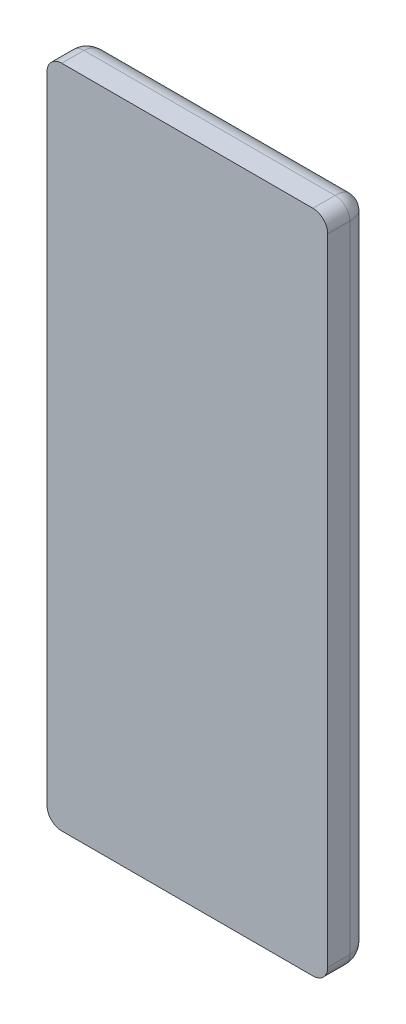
ISO-10303-21;
HEADER;
FILE_DESCRIPTION(('STEP AP214'),'2;1');
FILE_NAME('part.step','',(''),(''),'','','');
FILE_SCHEMA(('AUTOMOTIVE_DESIGN { 1 0 10303 214 1 1 1 1 }'));
ENDSEC;
DATA;
#1=APPLICATION_CONTEXT('core data for automotive mechanical design processes');
#2=APPLICATION_PROTOCOL_DEFINITION('international standard','automotive_design',2000,#1);
#3=PRODUCT_CONTEXT('',#1,'mechanical');
#4=PRODUCT('Part','Part','',(#3));
#5=PRODUCT_RELATED_PRODUCT_CATEGORY('part','',(#4));
#6=PRODUCT_DEFINITION_FORMATION('','',#4);
#7=PRODUCT_DEFINITION_CONTEXT('part definition',#1,'design');
#8=PRODUCT_DEFINITION('design','',#6,#7);
#9=PRODUCT_DEFINITION_SHAPE('','',#8);
#10=(LENGTH_UNIT() NAMED_UNIT(*) SI_UNIT(.MILLI.,.METRE.));
#11=(NAMED_UNIT(*) PLANE_ANGLE_UNIT() SI_UNIT($,.RADIAN.));
#12=(NAMED_UNIT(*) SI_UNIT($,.STERADIAN.) SOLID_ANGLE_UNIT());
#13=UNCERTAINTY_MEASURE_WITH_UNIT(LENGTH_MEASURE(1.E-05),#10,'distance_accuracy_value','');
#14=(GEOMETRIC_REPRESENTATION_CONTEXT(3) GLOBAL_UNCERTAINTY_ASSIGNED_CONTEXT((#13)) GLOBAL_UNIT_ASSIGNED_CONTEXT((#10,
#11,#12)) REPRESENTATION_CONTEXT('',''));
#15=CARTESIAN_POINT('',(0.,0.,0.));
#16=DIRECTION('',(0.,0.,1.));
#17=DIRECTION('',(1.,0.,0.));
#18=AXIS2_PLACEMENT_3D('',#15,#16,#17);
#19=CARTESIAN_POINT('',(8.5,-22.5,1.5));
#20=CARTESIAN_POINT('',(8.64959965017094,-22.5,1.5));
#21=CARTESIAN_POINT('',(8.87382146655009,-22.4486455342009,1.5));
#22=CARTESIAN_POINT('',(9.12870261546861,-22.2883274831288,1.5));
#23=CARTESIAN_POINT('',(9.31506466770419,-22.1021532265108,1.5));
#24=CARTESIAN_POINT('',(9.46187723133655,-21.836565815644,1.5));
#25=CARTESIAN_POINT('',(9.5,-21.6121997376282,1.5));
#26=CARTESIAN_POINT('',(9.5,-21.5,1.5));
#27=CARTESIAN_POINT('',(8.5,-22.5,1.38780026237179));
#28=CARTESIAN_POINT('',(8.64959965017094,-22.5,1.3765841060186));
#29=CARTESIAN_POINT('',(8.87382146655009,-22.4486455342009,1.36367785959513));
#30=CARTESIAN_POINT('',(9.12870261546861,-22.2883274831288,1.35659921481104));
#31=CARTESIAN_POINT('',(9.31506466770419,-22.1021532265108,1.3565890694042));
#32=CARTESIAN_POINT('',(9.46187723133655,-21.836565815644,1.36547389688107));
#33=CARTESIAN_POINT('',(9.5,-21.6121997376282,1.37940644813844));
#34=CARTESIAN_POINT('',(9.5,-21.5,1.38780026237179));
#35=CARTESIAN_POINT('',(8.49366788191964,-22.4810036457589,1.21952047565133));
#36=CARTESIAN_POINT('',(8.63881278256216,-22.477003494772,1.19182179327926));
#37=CARTESIAN_POINT('',(8.85635798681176,-22.4220191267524,1.15996321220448));
#38=CARTESIAN_POINT('',(9.10512871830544,-22.2621179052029,1.14250723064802));
#39=CARTESIAN_POINT('',(9.2883972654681,-22.0790138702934,1.14248074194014));
#40=CARTESIAN_POINT('',(9.4356110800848,-21.8202044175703,1.16439227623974));
#41=CARTESIAN_POINT('',(9.47798110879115,-21.6025209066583,1.19878205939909));
#42=CARTESIAN_POINT('',(9.48100364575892,-21.4936678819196,1.21952047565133));
#43=CARTESIAN_POINT('',(8.46256986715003,-22.3877096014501,0.8955879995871));
#44=CARTESIAN_POINT('',(8.58874628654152,-22.3682228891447,0.846188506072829));
#45=CARTESIAN_POINT('',(8.77793993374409,-22.3005097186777,0.789954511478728));
#46=CARTESIAN_POINT('',(8.99993494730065,-22.1445614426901,0.759259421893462));
#47=CARTESIAN_POINT('',(9.16875222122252,-21.9758598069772,0.759219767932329));
#48=CARTESIAN_POINT('',(9.31524917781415,-21.746468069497,0.797726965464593));
#49=CARTESIAN_POINT('',(9.37313062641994,-21.557213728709,0.858596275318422));
#50=CARTESIAN_POINT('',(9.38770960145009,-21.46256986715,0.895587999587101));
#51=CARTESIAN_POINT('',(8.38926968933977,-22.1678090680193,0.496981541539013));
#52=CARTESIAN_POINT('',(8.47892632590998,-22.1235422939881,0.445956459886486));
#53=CARTESIAN_POINT('',(8.61344255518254,-22.0389579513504,0.389505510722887));
#54=CARTESIAN_POINT('',(8.78105569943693,-21.898063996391,0.359036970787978));
#55=CARTESIAN_POINT('',(8.91759848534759,-21.7615567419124,0.359014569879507));
#56=CARTESIAN_POINT('',(9.05464864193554,-21.5910285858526,0.397176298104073));
#57=CARTESIAN_POINT('',(9.13468095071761,-21.4565326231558,0.45873955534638));
#58=CARTESIAN_POINT('',(9.16780906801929,-21.3892696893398,0.496981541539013));
#59=CARTESIAN_POINT('',(8.22436798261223,-21.6731039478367,0.102446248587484));
#60=CARTESIAN_POINT('',(8.26696463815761,-21.6301813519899,0.088462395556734));
#61=CARTESIAN_POINT('',(8.33089163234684,-21.5659542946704,0.073741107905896));
#62=CARTESIAN_POINT('',(8.41624895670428,-21.4803399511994,0.065956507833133));
#63=CARTESIAN_POINT('',(8.49103661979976,-21.4055651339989,0.065958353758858));
#64=CARTESIAN_POINT('',(8.57667160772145,-21.3202344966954,0.075679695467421));
#65=CARTESIAN_POINT('',(8.64096902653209,-21.256330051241,0.091946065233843));
#66=CARTESIAN_POINT('',(8.67310394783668,-21.2243679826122,0.102446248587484));
#67=CARTESIAN_POINT('',(8.07479982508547,-21.2243994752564,0.));
#68=CARTESIAN_POINT('',(8.08904741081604,-21.2101518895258,0.));
#69=CARTESIAN_POINT('',(8.11041878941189,-21.18878051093,0.));
#70=CARTESIAN_POINT('',(8.13891396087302,-21.1602853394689,0.));
#71=CARTESIAN_POINT('',(8.16384723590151,-21.1353520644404,0.));
#72=CARTESIAN_POINT('',(8.19234240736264,-21.1068568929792,0.));
#73=CARTESIAN_POINT('',(8.21371378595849,-21.0854855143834,0.));
#74=CARTESIAN_POINT('',(8.22439947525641,-21.0747998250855,0.));
#75=CARTESIAN_POINT('',(8.,-21.,0.));
#76=CARTESIAN_POINT('',(8.,-21.,0.));
#77=CARTESIAN_POINT('',(8.,-21.,0.));
#78=CARTESIAN_POINT('',(8.,-21.,0.));
#79=CARTESIAN_POINT('',(8.,-21.,0.));
#80=CARTESIAN_POINT('',(8.,-21.,0.));
#81=CARTESIAN_POINT('',(8.,-21.,0.));
#82=CARTESIAN_POINT('',(8.,-21.,0.));
#83=B_SPLINE_SURFACE_WITH_KNOTS('',3,3,((#19,#20,#21,#22,#23,#24,#25,#26),(#27,#28,#29,#30,#31,
#32,#33,#34),(#35,#36,#37,#38,#39,#40,#41,#42),(#43,#44,#45,#46,#47,#48,#49,#50),(#51,#52,#53,
#54,#55,#56,#57,#58),(#59,#60,#61,#62,#63,#64,#65,#66),(#67,#68,#69,#70,#71,#72,#73,#74),(#75,
#76,#77,#78,#79,#80,#81,#82)),.UNSPECIFIED.,.F.,.F.,.F.,(4,1,1,1,1,4),(4,1,1,1,1,4),(0.,
0.224399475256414,0.336599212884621,0.673198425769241,1.12199737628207,1.5707963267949),(0.,
0.285714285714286,0.428571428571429,0.571428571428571,0.785714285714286,1.),.UNSPECIFIED.);
#84=CARTESIAN_POINT('',(8.,-21.,0.));
#85=CARTESIAN_POINT('',(8.2243994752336,-21.0747998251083,0.));
#86=CARTESIAN_POINT('',(8.67310394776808,-21.2243679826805,0.102446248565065));
#87=CARTESIAN_POINT('',(9.16780906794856,-21.3892696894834,0.496981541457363));
#88=CARTESIAN_POINT('',(9.38770960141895,-21.4625698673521,0.89558799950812));
#89=CARTESIAN_POINT('',(9.48100364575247,-21.4936678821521,1.21952047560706));
#90=CARTESIAN_POINT('',(9.5,-21.5000000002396,1.38780026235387));
#91=CARTESIAN_POINT('',(9.5,-21.5000000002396,1.5));
#92=B_SPLINE_CURVE_WITH_KNOTS('',3,(#84,#85,#86,#87,#88,#89,#90,#91),.UNSPECIFIED.,.F.,.F.,(4,1,
1,1,1,4),(0.,0.448798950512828,0.897597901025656,1.23419711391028,1.34639685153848,
1.5707963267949),.UNSPECIFIED.);
#93=CARTESIAN_POINT('',(9.5,-21.5000000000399,1.5));
#94=VERTEX_POINT('',#93);
#95=CARTESIAN_POINT('',(8.,-21.,0.));
#96=VERTEX_POINT('',#95);
#97=EDGE_CURVE('E112',#94,#96,#92,.F.);
#98=CARTESIAN_POINT('',(9.5,-21.5,1.5));
#99=CARTESIAN_POINT('',(9.5,-21.6121997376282,1.5));
#100=CARTESIAN_POINT('',(9.46187723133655,-21.836565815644,1.5));
#101=CARTESIAN_POINT('',(9.31506466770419,-22.1021532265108,1.5));
#102=CARTESIAN_POINT('',(9.12870261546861,-22.2883274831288,1.5));
#103=CARTESIAN_POINT('',(8.87382146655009,-22.4486455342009,1.5));
#104=CARTESIAN_POINT('',(8.64959965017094,-22.5,1.5));
#105=CARTESIAN_POINT('',(8.5,-22.5,1.5));
#106=B_SPLINE_CURVE_WITH_KNOTS('',3,(#98,#99,#100,#101,#102,#103,#104,#105),.UNSPECIFIED.,.F.,
.F.,(4,1,1,1,1,4),(0.,0.214285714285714,0.428571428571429,0.571428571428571,0.714285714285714,
1.),.UNSPECIFIED.);
#107=CARTESIAN_POINT('',(8.5,-22.5,1.5));
#108=VERTEX_POINT('',#107);
#109=EDGE_CURVE('E95',#94,#108,#106,.T.);
#110=CARTESIAN_POINT('',(8.5,-22.5,1.5));
#111=CARTESIAN_POINT('',(8.50000003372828,-22.5000001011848,1.48036469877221));
#112=CARTESIAN_POINT('',(8.49987071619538,-22.4996121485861,1.46072956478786));
#113=CARTESIAN_POINT('',(8.49935489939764,-22.4980646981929,1.4214900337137));
#114=CARTESIAN_POINT('',(8.4989683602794,-22.4969050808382,1.40188564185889));
#115=CARTESIAN_POINT('',(8.49793945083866,-22.493818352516,1.36273758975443));
#116=CARTESIAN_POINT('',(8.49729699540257,-22.4918909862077,1.34319395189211));
#117=CARTESIAN_POINT('',(8.49575764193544,-22.4872729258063,1.30419727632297));
#118=CARTESIAN_POINT('',(8.49486061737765,-22.484581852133,1.2847442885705));
#119=CARTESIAN_POINT('',(8.49281352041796,-22.4784405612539,1.24595878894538));
#120=CARTESIAN_POINT('',(8.49166328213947,-22.4749898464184,1.22662636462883));
#121=CARTESIAN_POINT('',(8.48911106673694,-22.4673332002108,1.18811190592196));
#122=CARTESIAN_POINT('',(8.4877088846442,-22.4631266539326,1.16893000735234));
#123=CARTESIAN_POINT('',(8.48465444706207,-22.4539633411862,1.13074633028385));
#124=CARTESIAN_POINT('',(8.48300194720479,-22.4490058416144,1.11174474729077));
#125=CARTESIAN_POINT('',(8.47944958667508,-22.4383487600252,1.07395057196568));
#126=CARTESIAN_POINT('',(8.47754944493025,-22.4326483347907,1.05515824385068));
#127=CARTESIAN_POINT('',(8.47350412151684,-22.4205123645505,1.01781181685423));
#128=CARTESIAN_POINT('',(8.47135862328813,-22.4140758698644,0.999258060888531));
#129=CARTESIAN_POINT('',(8.46682603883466,-22.400478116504,0.962417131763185));
#130=CARTESIAN_POINT('',(8.46443860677,-22.39331582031,0.944130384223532));
#131=CARTESIAN_POINT('',(8.45942703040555,-22.3782810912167,0.907850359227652));
#132=CARTESIAN_POINT('',(8.45680252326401,-22.370407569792,0.889857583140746));
#133=CARTESIAN_POINT('',(8.45132138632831,-22.3539641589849,0.854192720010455));
#134=CARTESIAN_POINT('',(8.44846438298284,-22.3453931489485,0.836521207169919));
#135=CARTESIAN_POINT('',(8.44252291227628,-22.3275687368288,0.801526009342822));
#136=CARTESIAN_POINT('',(8.43943806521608,-22.3183141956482,0.784202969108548));
#137=CARTESIAN_POINT('',(8.43304554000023,-22.2991366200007,0.749931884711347));
#138=CARTESIAN_POINT('',(8.42973747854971,-22.2892124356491,0.732984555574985));
#139=CARTESIAN_POINT('',(8.42290316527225,-22.2687094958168,0.69949204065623));
#140=CARTESIAN_POINT('',(8.41937652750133,-22.258129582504,0.682947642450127));
#141=CARTESIAN_POINT('',(8.41210968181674,-22.2363290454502,0.650288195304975));
#142=CARTESIAN_POINT('',(8.40836908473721,-22.2251072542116,0.634174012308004));
#143=CARTESIAN_POINT('',(8.40067900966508,-22.2020370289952,0.602401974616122));
#144=CARTESIAN_POINT('',(8.39672913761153,-22.1901874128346,0.586745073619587));
#145=CARTESIAN_POINT('',(8.38862496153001,-22.16587488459,0.555915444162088));
#146=CARTESIAN_POINT('',(8.38447025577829,-22.1534107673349,0.540743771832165));
#147=CARTESIAN_POINT('',(8.37596400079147,-22.1278920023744,0.510904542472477));
#148=CARTESIAN_POINT('',(8.37161205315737,-22.1148361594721,0.496238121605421));
#149=CARTESIAN_POINT('',(8.36271930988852,-22.0881579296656,0.467428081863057));
#150=CARTESIAN_POINT('',(8.35817812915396,-22.0745343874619,0.453285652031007));
#151=CARTESIAN_POINT('',(8.34891479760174,-22.0467443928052,0.425542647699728));
#152=CARTESIAN_POINT('',(8.34419228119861,-22.0325768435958,0.411943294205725));
#153=CARTESIAN_POINT('',(8.3345741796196,-22.0037225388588,0.385305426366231));
#154=CARTESIAN_POINT('',(8.32967825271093,-21.9890347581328,0.372268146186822));
#155=CARTESIAN_POINT('',(8.31972121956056,-21.9591636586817,0.346773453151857));
#156=CARTESIAN_POINT('',(8.31465979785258,-21.9439793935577,0.334317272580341));
#157=CARTESIAN_POINT('',(8.30437966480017,-21.9131389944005,0.31000381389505));
#158=CARTESIAN_POINT('',(8.29916066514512,-21.8974819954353,0.298147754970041));
#159=CARTESIAN_POINT('',(8.2885732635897,-21.8657197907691,0.275053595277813));
#160=CARTESIAN_POINT('',(8.28320460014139,-21.8496138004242,0.2638166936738));
#161=CARTESIAN_POINT('',(8.27232576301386,-21.8169772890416,0.241979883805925));
#162=CARTESIAN_POINT('',(8.2668153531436,-21.8004460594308,0.231381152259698));
#163=CARTESIAN_POINT('',(8.25566090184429,-21.7669827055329,0.210839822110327));
#164=CARTESIAN_POINT('',(8.25001664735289,-21.7500499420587,0.200898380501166));
#165=CARTESIAN_POINT('',(8.23860244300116,-21.7158073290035,0.181690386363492));
#166=CARTESIAN_POINT('',(8.23283230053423,-21.6984969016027,0.17242497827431));
#167=CARTESIAN_POINT('',(8.22117405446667,-21.6635221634,0.154589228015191));
#168=CARTESIAN_POINT('',(8.21528577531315,-21.6458573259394,0.146020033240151));
#169=CARTESIAN_POINT('',(8.20340005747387,-21.6102001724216,0.129590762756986));
#170=CARTESIAN_POINT('',(8.19740246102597,-21.5922073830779,0.121731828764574));
#171=CARTESIAN_POINT('',(8.18530818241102,-21.5559245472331,0.106728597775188));
#172=CARTESIAN_POINT('',(8.1792113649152,-21.5376340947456,0.0995853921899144));
#173=CARTESIAN_POINT('',(8.16692846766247,-21.5007854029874,0.0860208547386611));
#174=CARTESIAN_POINT('',(8.16074227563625,-21.4822268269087,0.0796005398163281));
#175=CARTESIAN_POINT('',(8.14829052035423,-21.4448715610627,0.0674885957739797));
#176=CARTESIAN_POINT('',(8.14202486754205,-21.4260746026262,0.0617978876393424));
#177=CARTESIAN_POINT('',(8.12942406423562,-21.3882721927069,0.0511521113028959));
#178=CARTESIAN_POINT('',(8.12308884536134,-21.369266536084,0.0461978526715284));
#179=CARTESIAN_POINT('',(8.11035879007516,-21.3310763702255,0.0370319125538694));
#180=CARTESIAN_POINT('',(8.10396390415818,-21.3118917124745,0.0328209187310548));
#181=CARTESIAN_POINT('',(8.09112439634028,-21.2733731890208,0.0251484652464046));
#182=CARTESIAN_POINT('',(8.08467974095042,-21.2540392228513,0.021687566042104));
#183=CARTESIAN_POINT('',(8.07175057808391,-21.2152517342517,0.0155222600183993));
#184=CARTESIAN_POINT('',(8.06526604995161,-21.1957981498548,0.0128182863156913));
#185=CARTESIAN_POINT('',(8.05226703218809,-21.1568010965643,0.00817379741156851));
#186=CARTESIAN_POINT('',(8.04575253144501,-21.137257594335,0.00623359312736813));
#187=CARTESIAN_POINT('',(8.0327034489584,-21.0981103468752,0.00312357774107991));
#188=CARTESIAN_POINT('',(8.02616886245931,-21.0785065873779,0.00195396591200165));
#189=CARTESIAN_POINT('',(8.01308954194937,-21.0392686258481,0.000392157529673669));
#190=CARTESIAN_POINT('',(8.00654480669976,-21.0196344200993,6.48301374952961E-08));
#191=CARTESIAN_POINT('',(8.,-21.,0.));
#192=B_SPLINE_CURVE_WITH_KNOTS('',3,(#110,#111,#112,#113,#114,#115,#116,#117,#118,#119,#120,
#121,#122,#123,#124,#125,#126,#127,#128,#129,#130,#131,#132,#133,#134,#135,#136,#137,#138,#139,
#140,#141,#142,#143,#144,#145,#146,#147,#148,#149,#150,#151,#152,#153,#154,#155,#156,#157,#158,
#159,#160,#161,#162,#163,#164,#165,#166,#167,#168,#169,#170,#171,#172,#173,#174,#175,#176,#177,
#178,#179,#180,#181,#182,#183,#184,#185,#186,#187,#188,#189,#190,#191),.UNSPECIFIED.,.F.,.F.,(4,
2,2,2,2,2,2,2,2,2,2,2,2,2,2,2,2,2,2,2,2,2,2,2,2,2,2,2,2,2,2,2,2,2,2,2,2,2,2,2,4),(0.,
0.0589014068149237,0.117811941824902,0.176742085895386,0.235701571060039,0.294699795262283,
0.35374623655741,0.412850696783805,0.472022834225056,0.531272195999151,0.590607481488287,
0.65003516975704,0.709560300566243,0.769186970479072,0.828918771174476,0.888759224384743,
0.948712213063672,1.00878240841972,1.06897550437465,1.12929613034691,1.1897461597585,
1.25032521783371,1.31103114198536,1.37186043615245,1.43280871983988,1.49387117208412,
1.5550429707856,1.61631972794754,1.67769792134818,1.73917529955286,1.80074980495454,
1.86241682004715,1.92416953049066,1.98599943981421,2.0478968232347,2.10985117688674,
2.17185166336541,2.23388755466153,2.29594867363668,2.35802583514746,2.42011128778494),.UNSPECIFIED.);
#193=EDGE_CURVE('E116',#96,#108,#192,.F.);
#194=ORIENTED_EDGE('',*,*,#97,.F.);
#195=ORIENTED_EDGE('',*,*,#109,.T.);
#196=ORIENTED_EDGE('',*,*,#193,.F.);
#197=EDGE_LOOP('',(#194,#195,#196));
#198=FACE_BOUND('',#197,.T.);
#199=ADVANCED_FACE('F15',(#198),#83,.T.);
#200=CARTESIAN_POINT('',(9.5,21.5,1.5));
#201=CARTESIAN_POINT('',(9.5,21.6495996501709,1.5));
#202=CARTESIAN_POINT('',(9.44864553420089,21.8738214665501,1.5));
#203=CARTESIAN_POINT('',(9.28832748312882,22.1287026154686,1.5));
#204=CARTESIAN_POINT('',(9.10215322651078,22.3150646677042,1.5));
#205=CARTESIAN_POINT('',(8.83656581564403,22.4618772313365,1.5));
#206=CARTESIAN_POINT('',(8.61219973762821,22.5,1.5));
#207=CARTESIAN_POINT('',(8.5,22.5,1.5));
#208=CARTESIAN_POINT('',(9.5,21.5,1.38780026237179));
#209=CARTESIAN_POINT('',(9.5,21.6495996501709,1.3765841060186));
#210=CARTESIAN_POINT('',(9.44864553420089,21.8738214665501,1.36367785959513));
#211=CARTESIAN_POINT('',(9.28832748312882,22.1287026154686,1.35659921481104));
#212=CARTESIAN_POINT('',(9.10215322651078,22.3150646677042,1.3565890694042));
#213=CARTESIAN_POINT('',(8.83656581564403,22.4618772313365,1.36547389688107));
#214=CARTESIAN_POINT('',(8.61219973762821,22.5,1.37940644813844));
#215=CARTESIAN_POINT('',(8.5,22.5,1.38780026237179));
#216=CARTESIAN_POINT('',(9.47476072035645,21.4915869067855,1.163380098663));
#217=CARTESIAN_POINT('',(9.46929669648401,21.6351581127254,1.12990891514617));
#218=CARTESIAN_POINT('',(9.4129652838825,21.8503523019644,1.09140918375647));
#219=CARTESIAN_POINT('',(9.25311469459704,22.0970070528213,1.07031256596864));
#220=CARTESIAN_POINT('',(9.07103700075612,22.2792434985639,1.07028071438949));
#221=CARTESIAN_POINT('',(8.8145859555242,22.4266996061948,1.09676198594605));
#222=CARTESIAN_POINT('',(8.59926085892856,22.4706437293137,1.13832083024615));
#223=CARTESIAN_POINT('',(8.49158690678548,22.4747607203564,1.163380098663));
#224=CARTESIAN_POINT('',(9.36281472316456,21.4542715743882,0.843748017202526));
#225=CARTESIAN_POINT('',(9.33967416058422,21.5757474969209,0.793183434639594));
#226=CARTESIAN_POINT('',(9.2691248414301,21.7579074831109,0.73583104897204));
#227=CARTESIAN_POINT('',(9.1145041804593,21.9731253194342,0.704568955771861));
#228=CARTESIAN_POINT('',(8.94958719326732,22.1381455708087,0.704530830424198));
#229=CARTESIAN_POINT('',(8.72759901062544,22.28409095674,0.743741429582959));
#230=CARTESIAN_POINT('',(8.54539176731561,22.3455013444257,0.805880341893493));
#231=CARTESIAN_POINT('',(8.45427157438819,22.3628147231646,0.843748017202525));
#232=CARTESIAN_POINT('',(9.12276814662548,21.3742560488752,0.461132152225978));
#233=CARTESIAN_POINT('',(9.0786856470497,21.4596938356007,0.413727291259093));
#234=CARTESIAN_POINT('',(8.99606753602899,21.5878836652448,0.361368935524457));
#235=CARTESIAN_POINT('',(8.86026237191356,21.7480706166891,0.333128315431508));
#236=CARTESIAN_POINT('',(8.72937415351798,21.8789945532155,0.333108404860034));
#237=CARTESIAN_POINT('',(8.56652382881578,22.0112894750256,0.368476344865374));
#238=CARTESIAN_POINT('',(8.43835563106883,22.0897821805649,0.425600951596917));
#239=CARTESIAN_POINT('',(8.37425604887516,22.1227681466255,0.461132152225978));
#240=CARTESIAN_POINT('',(8.67314741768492,21.2243824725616,0.102440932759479));
#241=CARTESIAN_POINT('',(8.63018395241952,21.2669351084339,0.088227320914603));
#242=CARTESIAN_POINT('',(8.56588323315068,21.3307975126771,0.073227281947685));
#243=CARTESIAN_POINT('',(8.48021816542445,21.4161207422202,0.065286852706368));
#244=CARTESIAN_POINT('',(8.40543559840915,21.4909156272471,0.065288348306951));
#245=CARTESIAN_POINT('',(8.32015056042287,21.5766129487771,0.075205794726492));
#246=CARTESIAN_POINT('',(8.25631179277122,21.6409824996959,0.091769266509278));
#247=CARTESIAN_POINT('',(8.22438247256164,21.6731474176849,0.102440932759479));
#248=CARTESIAN_POINT('',(8.22439947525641,21.0747998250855,0.));
#249=CARTESIAN_POINT('',(8.21015188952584,21.089047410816,0.));
#250=CARTESIAN_POINT('',(8.18878051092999,21.1104187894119,0.));
#251=CARTESIAN_POINT('',(8.16028533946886,21.138913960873,0.));
#252=CARTESIAN_POINT('',(8.13535206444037,21.1638472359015,0.));
#253=CARTESIAN_POINT('',(8.10685689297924,21.1923424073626,0.));
#254=CARTESIAN_POINT('',(8.08548551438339,21.2137137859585,0.));
#255=CARTESIAN_POINT('',(8.07479982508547,21.2243994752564,0.));
#256=CARTESIAN_POINT('',(7.99999999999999,21.,0.));
#257=CARTESIAN_POINT('',(7.99999999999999,21.,0.));
#258=CARTESIAN_POINT('',(7.99999999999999,21.,0.));
#259=CARTESIAN_POINT('',(7.99999999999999,21.,0.));
#260=CARTESIAN_POINT('',(7.99999999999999,21.,0.));
#261=CARTESIAN_POINT('',(7.99999999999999,21.,0.));
#262=CARTESIAN_POINT('',(7.99999999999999,21.,0.));
#263=CARTESIAN_POINT('',(7.99999999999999,21.,0.));
#264=B_SPLINE_SURFACE_WITH_KNOTS('',3,3,((#200,#201,#202,#203,#204,#205,#206,#207),(#208,#209,
#210,#211,#212,#213,#214,#215),(#216,#217,#218,#219,#220,#221,#222,#223),(#224,#225,#226,#227,
#228,#229,#230,#231),(#232,#233,#234,#235,#236,#237,#238,#239),(#240,#241,#242,#243,#244,#245,
#246,#247),(#248,#249,#250,#251,#252,#253,#254,#255),(#256,#257,#258,#259,#260,#261,#262,#263)),
.UNSPECIFIED.,.F.,.F.,.F.,(4,1,1,1,1,4),(4,1,1,1,1,4),(0.,0.224399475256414,0.448798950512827,
0.673198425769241,1.12199737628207,1.5707963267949),(0.,0.285714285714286,0.428571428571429,
0.571428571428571,0.785714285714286,1.),.UNSPECIFIED.);
#265=CARTESIAN_POINT('',(7.99999999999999,21.,0.));
#266=CARTESIAN_POINT('',(8.07479982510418,21.2243994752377,0.));
#267=CARTESIAN_POINT('',(8.22438247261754,21.6731474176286,0.102440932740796));
#268=CARTESIAN_POINT('',(8.37425604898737,22.1227681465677,0.461132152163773));
#269=CARTESIAN_POINT('',(8.45427157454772,22.3628147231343,0.84374801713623));
#270=CARTESIAN_POINT('',(8.49158690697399,22.4747607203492,1.16338009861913));
#271=CARTESIAN_POINT('',(8.50000000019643,22.5,1.3878002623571));
#272=CARTESIAN_POINT('',(8.50000000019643,22.5,1.5));
#273=B_SPLINE_CURVE_WITH_KNOTS('',3,(#265,#266,#267,#268,#269,#270,#271,#272),.UNSPECIFIED.,.F.,
.F.,(4,1,1,1,1,4),(0.,0.448798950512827,0.897597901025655,1.12199737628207,1.34639685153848,
1.5707963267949),.UNSPECIFIED.);
#274=CARTESIAN_POINT('',(8.50000000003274,22.5,1.5));
#275=VERTEX_POINT('',#274);
#276=CARTESIAN_POINT('',(8.,21.,0.));
#277=VERTEX_POINT('',#276);
#278=EDGE_CURVE('E231',#275,#277,#273,.F.);
#279=CARTESIAN_POINT('',(8.5,22.5,1.5));
#280=CARTESIAN_POINT('',(8.51308989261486,22.5000000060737,1.5));
#281=CARTESIAN_POINT('',(8.5261796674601,22.4997405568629,1.5));
#282=CARTESIAN_POINT('',(8.55233882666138,22.4987061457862,1.5));
#283=CARTESIAN_POINT('',(8.56540821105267,22.4979311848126,1.5));
#284=CARTESIAN_POINT('',(8.59150660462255,22.4958691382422,1.5));
#285=CARTESIAN_POINT('',(8.60453561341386,22.4945820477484,1.5));
#286=CARTESIAN_POINT('',(8.63053335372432,22.491499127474,1.5));
#287=CARTESIAN_POINT('',(8.64350208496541,22.4897032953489,1.5));
#288=CARTESIAN_POINT('',(8.66935934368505,22.4856062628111,1.5));
#289=CARTESIAN_POINT('',(8.68224787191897,22.4833050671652,1.5));
#290=CARTESIAN_POINT('',(8.70792480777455,22.4782006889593,1.5));
#291=CARTESIAN_POINT('',(8.72071321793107,22.4753975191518,1.5));
#292=CARTESIAN_POINT('',(8.74616997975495,22.4692925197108,1.5));
#293=CARTESIAN_POINT('',(8.75883833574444,22.4659907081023,1.5));
#294=CARTESIAN_POINT('',(8.78403512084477,22.4588919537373,1.5));
#295=CARTESIAN_POINT('',(8.79656355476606,22.4550950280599,1.5));
#296=CARTESIAN_POINT('',(8.82146036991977,22.4470088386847,1.5));
#297=CARTESIAN_POINT('',(8.83382875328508,22.4427195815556,1.5));
#298=CARTESIAN_POINT('',(8.85838633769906,22.4336548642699,1.5));
#299=CARTESIAN_POINT('',(8.87057553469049,22.4288793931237,1.5));
#300=CARTESIAN_POINT('',(8.89475724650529,22.4188528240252,1.5));
#301=CARTESIAN_POINT('',(8.90674975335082,22.4136017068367,1.5));
#302=CARTESIAN_POINT('',(8.9305202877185,22.4026335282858,1.5));
#303=CARTESIAN_POINT('',(8.94229830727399,22.3969164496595,1.5));
#304=CARTESIAN_POINT('',(8.96562214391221,22.3850262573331,1.5));
#305=CARTESIAN_POINT('',(8.97716795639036,22.3788531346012,1.5));
#306=CARTESIAN_POINT('',(9.00000962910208,22.3660606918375,1.5));
#307=CARTESIAN_POINT('',(9.0113054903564,22.3594413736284,1.5));
#308=CARTESIAN_POINT('',(9.03362952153,22.3457663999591,1.5));
#309=CARTESIAN_POINT('',(9.04465769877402,22.338710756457,1.5));
#310=CARTESIAN_POINT('',(9.06642859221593,22.3241729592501,1.5));
#311=CARTESIAN_POINT('',(9.0771713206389,22.3166908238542,1.5));
#312=CARTESIAN_POINT('',(9.09835365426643,22.3013099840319,1.5));
#313=CARTESIAN_POINT('',(9.10879327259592,22.2934112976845,1.5));
#314=CARTESIAN_POINT('',(9.12935133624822,22.277206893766,1.5));
#315=CARTESIAN_POINT('',(9.13946978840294,22.2689011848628,1.5));
#316=CARTESIAN_POINT('',(9.15937133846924,22.2518970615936,1.5));
#317=CARTESIAN_POINT('',(9.16915443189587,22.2431986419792,1.5));
#318=CARTESIAN_POINT('',(9.18837175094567,22.2254240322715,1.5));
#319=CARTESIAN_POINT('',(9.19780596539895,22.2163478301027,1.5));
#320=CARTESIAN_POINT('',(9.21631183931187,22.1978324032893,1.5));
#321=CARTESIAN_POINT('',(9.22538348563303,22.1883931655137,1.5));
#322=CARTESIAN_POINT('',(9.24315059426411,22.1691664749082,1.5));
#323=CARTESIAN_POINT('',(9.25184604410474,22.1593790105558,1.5));
#324=CARTESIAN_POINT('',(9.26884704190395,22.1394705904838,1.5));
#325=CARTESIAN_POINT('',(9.27715257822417,22.1293496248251,1.5));
#326=CARTESIAN_POINT('',(9.2933602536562,22.1087892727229,1.5));
#327=CARTESIAN_POINT('',(9.30126238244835,22.0983498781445,1.5));
#328=CARTESIAN_POINT('',(9.31665164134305,22.0771695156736,1.5));
#329=CARTESIAN_POINT('',(9.32413877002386,22.0664285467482,1.5));
#330=CARTESIAN_POINT('',(9.33868624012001,22.0446617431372,1.5));
#331=CARTESIAN_POINT('',(9.34574659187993,22.0336359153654,1.5));
#332=CARTESIAN_POINT('',(9.359428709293,22.0113161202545,1.5));
#333=CARTESIAN_POINT('',(9.36605049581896,22.0000221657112,1.5));
#334=CARTESIAN_POINT('',(9.37884387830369,21.9771829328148,1.5));
#335=CARTESIAN_POINT('',(9.38501550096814,21.9656376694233,1.5));
#336=CARTESIAN_POINT('',(9.39689619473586,21.9423122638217,1.5));
#337=CARTESIAN_POINT('',(9.40260528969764,21.9305321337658,1.5));
#338=CARTESIAN_POINT('',(9.41355200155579,21.9067550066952,1.5));
#339=CARTESIAN_POINT('',(9.41878962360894,21.8947580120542,1.5));
#340=CARTESIAN_POINT('',(9.42878927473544,21.8705670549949,1.5));
#341=CARTESIAN_POINT('',(9.43355128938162,21.8583730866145,1.5));
#342=CARTESIAN_POINT('',(9.44259470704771,21.8338076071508,1.5));
#343=CARTESIAN_POINT('',(9.44687608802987,21.8214360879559,1.5));
#344=CARTESIAN_POINT('',(9.45495344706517,21.796535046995,1.5));
#345=CARTESIAN_POINT('',(9.45874940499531,21.7840055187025,1.5));
#346=CARTESIAN_POINT('',(9.46585105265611,21.7588079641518,1.5));
#347=CARTESIAN_POINT('',(9.46915673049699,21.7461399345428,1.5));
#348=CARTESIAN_POINT('',(9.47527296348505,21.7206848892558,1.5));
#349=CARTESIAN_POINT('',(9.47808351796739,21.7078978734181,1.5));
#350=CARTESIAN_POINT('',(9.48320464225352,21.6822243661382,1.5));
#351=CARTESIAN_POINT('',(9.48551522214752,21.669337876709,1.5));
#352=CARTESIAN_POINT('',(9.48963153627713,21.6434849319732,1.5));
#353=CARTESIAN_POINT('',(9.49143728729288,21.6305184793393,1.5));
#354=CARTESIAN_POINT('',(9.49453908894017,21.6045251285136,1.5));
#355=CARTESIAN_POINT('',(9.49583515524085,21.5914982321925,1.5));
#356=CARTESIAN_POINT('',(9.49791273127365,21.5654034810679,1.5));
#357=CARTESIAN_POINT('',(9.49869424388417,21.5523356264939,1.5));
#358=CARTESIAN_POINT('',(9.49973790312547,21.5261785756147,1.5));
#359=CARTESIAN_POINT('',(9.50000002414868,21.5130893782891,1.5));
#360=CARTESIAN_POINT('',(9.5,21.5,1.5));
#361=B_SPLINE_CURVE_WITH_KNOTS('',3,(#279,#280,#281,#282,#283,#284,#285,#286,#287,#288,#289,
#290,#291,#292,#293,#294,#295,#296,#297,#298,#299,#300,#301,#302,#303,#304,#305,#306,#307,#308,
#309,#310,#311,#312,#313,#314,#315,#316,#317,#318,#319,#320,#321,#322,#323,#324,#325,#326,#327,
#328,#329,#330,#331,#332,#333,#334,#335,#336,#337,#338,#339,#340,#341,#342,#343,#344,#345,#346,
#347,#348,#349,#350,#351,#352,#353,#354,#355,#356,#357,#358,#359,#360),.UNSPECIFIED.,.F.,.F.,(4,
2,2,2,2,2,2,2,2,2,2,2,2,2,2,2,2,2,2,2,2,2,2,2,2,2,2,2,2,2,2,2,2,2,2,2,2,2,2,2,4),(0.,
0.039266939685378,0.0785338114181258,0.117801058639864,0.157068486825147,0.19633554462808,
0.235601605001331,0.274866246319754,0.314129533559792,0.353392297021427,0.392655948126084,
0.431921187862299,0.471187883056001,0.510455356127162,0.54972266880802,0.588988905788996,
0.628253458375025,0.66751630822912,0.706778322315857,0.746040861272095,0.785304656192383,
0.82456987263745,0.863836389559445,0.90310407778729,0.942372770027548,0.981641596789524,
1.02090947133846,1.06017547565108,1.09943914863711,1.13870079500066,1.17796201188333,
1.2172244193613,1.25648862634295,1.29575446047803,1.33502124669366,1.37428808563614,
1.413554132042,1.4528188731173,1.49208240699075,1.53134572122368,1.5706109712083),.UNSPECIFIED.);
#362=CARTESIAN_POINT('',(9.5,21.5,1.5));
#363=VERTEX_POINT('',#362);
#364=EDGE_CURVE('E108',#275,#363,#361,.T.);
#365=CARTESIAN_POINT('',(9.5,21.5,1.5));
#366=CARTESIAN_POINT('',(9.50000008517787,21.5000000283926,1.48036412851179));
#367=CARTESIAN_POINT('',(9.49961349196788,21.4998711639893,1.46072837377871));
#368=CARTESIAN_POINT('',(9.49807041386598,21.499356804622,1.42148669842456));
#369=CARTESIAN_POINT('',(9.49691378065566,21.4989712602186,1.40188078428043));
#370=CARTESIAN_POINT('',(9.49383356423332,21.4979445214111,1.36272929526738));
#371=CARTESIAN_POINT('',(9.49190971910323,21.4973032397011,1.34318374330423));
#372=CARTESIAN_POINT('',(9.48729809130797,21.495766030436,1.30418340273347));
#373=CARTESIAN_POINT('',(9.48460993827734,21.4948699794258,1.28472866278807));
#374=CARTESIAN_POINT('',(9.47847283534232,21.4928242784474,1.24594034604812));
#375=CARTESIAN_POINT('',(9.47502340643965,21.4916744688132,1.22660685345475));
#376=CARTESIAN_POINT('',(9.4673662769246,21.4891220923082,1.18809155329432));
#377=CARTESIAN_POINT('',(9.46315798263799,21.487719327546,1.1689098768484));
#378=CARTESIAN_POINT('',(9.45398815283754,21.4846627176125,1.13072809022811));
#379=CARTESIAN_POINT('',(9.44902589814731,21.4830086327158,1.11172817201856));
#380=CARTESIAN_POINT('',(9.43835981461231,21.4794532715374,1.07393767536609));
#381=CARTESIAN_POINT('',(9.43265515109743,21.4775517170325,1.05514735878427));
#382=CARTESIAN_POINT('',(9.42051485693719,21.4735049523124,1.0178040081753));
#383=CARTESIAN_POINT('',(9.41407829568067,21.4713594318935,0.999251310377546));
#384=CARTESIAN_POINT('',(9.40048503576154,21.4668283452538,0.962411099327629));
#385=CARTESIAN_POINT('',(9.39332732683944,21.4644424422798,0.94412400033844));
#386=CARTESIAN_POINT('',(9.37830263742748,21.4594342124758,0.90784283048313));
#387=CARTESIAN_POINT('',(9.37043457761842,21.4568115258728,0.889849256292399));
#388=CARTESIAN_POINT('',(9.35399960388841,21.4513332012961,0.854183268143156));
#389=CARTESIAN_POINT('',(9.34543154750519,21.4484771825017,0.83651143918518));
#390=CARTESIAN_POINT('',(9.32760973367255,21.4425365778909,0.801516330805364));
#391=CARTESIAN_POINT('',(9.31835479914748,21.4394515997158,0.784193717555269));
#392=CARTESIAN_POINT('',(9.29917430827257,21.4330581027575,0.749923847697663));
#393=CARTESIAN_POINT('',(9.28924756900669,21.4297491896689,0.732977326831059));
#394=CARTESIAN_POINT('',(9.26873814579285,21.4229127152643,0.699486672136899));
#395=CARTESIAN_POINT('',(9.25815427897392,21.419384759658,0.682943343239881));
#396=CARTESIAN_POINT('',(9.2363453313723,21.4121151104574,0.650286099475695));
#397=CARTESIAN_POINT('',(9.22511906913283,21.4083730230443,0.634173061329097));
#398=CARTESIAN_POINT('',(9.20204022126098,21.4006800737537,0.602403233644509));
#399=CARTESIAN_POINT('',(9.19018645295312,21.396728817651,0.586747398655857));
#400=CARTESIAN_POINT('',(9.16586678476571,21.3886222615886,0.555919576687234));
#401=CARTESIAN_POINT('',(9.15339969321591,21.3844665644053,0.540748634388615));
#402=CARTESIAN_POINT('',(9.12787612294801,21.3759587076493,0.510910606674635));
#403=CARTESIAN_POINT('',(9.11481846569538,21.3716061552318,0.496244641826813));
#404=CARTESIAN_POINT('',(9.08813757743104,21.3627125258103,0.467435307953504));
#405=CARTESIAN_POINT('',(9.07451320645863,21.3581710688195,0.453293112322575));
#406=CARTESIAN_POINT('',(9.04672237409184,21.3489074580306,0.425550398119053));
#407=CARTESIAN_POINT('',(9.03255482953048,21.3441849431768,0.411951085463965));
#408=CARTESIAN_POINT('',(9.00370119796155,21.3345670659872,0.38531315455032));
#409=CARTESIAN_POINT('',(8.98901409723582,21.3296713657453,0.37227575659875));
#410=CARTESIAN_POINT('',(8.95914486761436,21.3197149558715,0.346780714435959));
#411=CARTESIAN_POINT('',(8.94396180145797,21.3146539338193,0.334324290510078));
#412=CARTESIAN_POINT('',(8.91312415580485,21.3043747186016,0.310010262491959));
#413=CARTESIAN_POINT('',(8.89746871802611,21.299156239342,0.298153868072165));
#414=CARTESIAN_POINT('',(8.86570983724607,21.2885699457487,0.275058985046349));
#415=CARTESIAN_POINT('',(8.8496056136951,21.2832018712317,0.263821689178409));
#416=CARTESIAN_POINT('',(8.81697268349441,21.2723242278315,0.241984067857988));
#417=CARTESIAN_POINT('',(8.80044326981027,21.2668144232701,0.231384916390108));
#418=CARTESIAN_POINT('',(8.76698344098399,21.2556611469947,0.210842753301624));
#419=CARTESIAN_POINT('',(8.75005238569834,21.2500174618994,0.200900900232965));
#420=CARTESIAN_POINT('',(8.71581292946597,21.238604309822,0.181692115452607));
#421=CARTESIAN_POINT('',(8.69850394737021,21.2328346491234,0.172426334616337));
#422=CARTESIAN_POINT('',(8.66353168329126,21.2211772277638,0.154589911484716));
#423=CARTESIAN_POINT('',(8.6458678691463,21.2152892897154,0.146020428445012));
#424=CARTESIAN_POINT('',(8.61021229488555,21.2034040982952,0.129590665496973));
#425=CARTESIAN_POINT('',(8.59222005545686,21.1974066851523,0.1217315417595));
#426=CARTESIAN_POINT('',(8.55593792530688,21.185312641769,0.106727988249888));
#427=CARTESIAN_POINT('',(8.53764762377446,21.1792158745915,0.099584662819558));
#428=CARTESIAN_POINT('',(8.50079891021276,21.1669329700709,0.0860199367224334));
#429=CARTESIAN_POINT('',(8.48224015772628,21.1607467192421,0.0795995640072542));
#430=CARTESIAN_POINT('',(8.44488428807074,21.1482947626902,0.0674875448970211));
#431=CARTESIAN_POINT('',(8.42608689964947,21.1420289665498,0.0617968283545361));
#432=CARTESIAN_POINT('',(8.38828345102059,21.1294278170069,0.0511510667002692));
#433=CARTESIAN_POINT('',(8.36927718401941,21.1230923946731,0.046196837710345));
#434=CARTESIAN_POINT('',(8.33108569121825,21.1103618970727,0.0370309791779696));
#435=CARTESIAN_POINT('',(8.31190031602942,21.1039667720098,0.0328200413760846));
#436=CARTESIAN_POINT('',(8.27338032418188,21.0911267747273,0.0251477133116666));
#437=CARTESIAN_POINT('',(8.25404560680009,21.0846818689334,0.0216868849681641));
#438=CARTESIAN_POINT('',(8.21525665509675,21.0717522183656,0.0155217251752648));
#439=CARTESIAN_POINT('',(8.19580235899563,21.0652674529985,0.0128178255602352));
#440=CARTESIAN_POINT('',(8.15680399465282,21.0522679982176,0.00817348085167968));
#441=CARTESIAN_POINT('',(8.13725989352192,21.0457532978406,0.00623334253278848));
#442=CARTESIAN_POINT('',(8.09811163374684,21.0327038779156,0.00312344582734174));
#443=CARTESIAN_POINT('',(8.07850746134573,21.0261691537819,0.00195387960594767));
#444=CARTESIAN_POINT('',(8.03926893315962,21.0130896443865,0.000392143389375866));
#445=CARTESIAN_POINT('',(8.01963457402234,21.0065448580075,6.70825923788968E-08));
#446=CARTESIAN_POINT('',(7.99999999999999,21.,0.));
#447=B_SPLINE_CURVE_WITH_KNOTS('',3,(#365,#366,#367,#368,#369,#370,#371,#372,#373,#374,#375,
#376,#377,#378,#379,#380,#381,#382,#383,#384,#385,#386,#387,#388,#389,#390,#391,#392,#393,#394,
#395,#396,#397,#398,#399,#400,#401,#402,#403,#404,#405,#406,#407,#408,#409,#410,#411,#412,#413,
#414,#415,#416,#417,#418,#419,#420,#421,#422,#423,#424,#425,#426,#427,#428,#429,#430,#431,#432,
#433,#434,#435,#436,#437,#438,#439,#440,#441,#442,#443,#444,#445,#446),.UNSPECIFIED.,.F.,.F.,(4,
2,2,2,2,2,2,2,2,2,2,2,2,2,2,2,2,2,2,2,2,2,2,2,2,2,2,2,2,2,2,2,2,2,2,2,2,2,2,2,4),(0.,
0.0589032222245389,0.117817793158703,0.176752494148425,0.235715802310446,0.294716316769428,
0.353763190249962,0.412866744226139,0.472037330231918,0.531284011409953,0.590614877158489,
0.650037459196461,0.709559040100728,0.769185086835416,0.828919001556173,0.888763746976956,
0.948722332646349,1.00879825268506,1.06899590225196,1.12931949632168,1.18977093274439,
1.25034992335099,1.31105444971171,1.37188121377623,1.43282608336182,1.49388453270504,
1.55505207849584,1.61632471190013,1.67769932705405,1.73917411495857,1.80074722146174,
1.86241390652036,1.92416719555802,1.98599841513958,2.04789764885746,2.10985418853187,
2.17185698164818,2.23389507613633,2.29595806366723,2.35803652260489,2.42012246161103),.UNSPECIFIED.);
#448=EDGE_CURVE('E123',#277,#363,#447,.F.);
#449=ORIENTED_EDGE('',*,*,#278,.F.);
#450=ORIENTED_EDGE('',*,*,#364,.T.);
#451=ORIENTED_EDGE('',*,*,#448,.F.);
#452=EDGE_LOOP('',(#449,#450,#451));
#453=FACE_BOUND('',#452,.T.);
#454=ADVANCED_FACE('F331',(#453),#264,.T.);
#455=CARTESIAN_POINT('',(-8.5,22.5,1.5));
#456=CARTESIAN_POINT('',(-8.64959965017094,22.5,1.5));
#457=CARTESIAN_POINT('',(-8.87382146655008,22.4486455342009,1.5));
#458=CARTESIAN_POINT('',(-9.12870261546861,22.2883274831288,1.5));
#459=CARTESIAN_POINT('',(-9.31506466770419,22.1021532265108,1.5));
#460=CARTESIAN_POINT('',(-9.46187723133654,21.836565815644,1.5));
#461=CARTESIAN_POINT('',(-9.5,21.6121997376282,1.5));
#462=CARTESIAN_POINT('',(-9.5,21.5,1.5));
#463=CARTESIAN_POINT('',(-8.5,22.5,1.38780026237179));
#464=CARTESIAN_POINT('',(-8.64959965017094,22.5,1.3765841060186));
#465=CARTESIAN_POINT('',(-8.87382146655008,22.4486455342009,1.36367785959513));
#466=CARTESIAN_POINT('',(-9.12870261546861,22.2883274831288,1.35659921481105));
#467=CARTESIAN_POINT('',(-9.31506466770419,22.1021532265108,1.3565890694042));
#468=CARTESIAN_POINT('',(-9.46187723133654,21.836565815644,1.36547389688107));
#469=CARTESIAN_POINT('',(-9.5,21.6121997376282,1.37940644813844));
#470=CARTESIAN_POINT('',(-9.5,21.5,1.38780026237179));
#471=CARTESIAN_POINT('',(-8.49366788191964,22.4810036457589,1.21952047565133));
#472=CARTESIAN_POINT('',(-8.63881278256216,22.477003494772,1.19182179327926));
#473=CARTESIAN_POINT('',(-8.85635798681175,22.4220191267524,1.15996321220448));
#474=CARTESIAN_POINT('',(-9.10512871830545,22.2621179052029,1.14250723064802));
#475=CARTESIAN_POINT('',(-9.28839726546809,22.0790138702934,1.14248074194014));
#476=CARTESIAN_POINT('',(-9.4356110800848,21.8202044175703,1.16439227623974));
#477=CARTESIAN_POINT('',(-9.47798110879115,21.6025209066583,1.19878205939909));
#478=CARTESIAN_POINT('',(-9.48100364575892,21.4936678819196,1.21952047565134));
#479=CARTESIAN_POINT('',(-8.46256986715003,22.3877096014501,0.8955879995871));
#480=CARTESIAN_POINT('',(-8.58874628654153,22.3682228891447,0.84618850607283));
#481=CARTESIAN_POINT('',(-8.77793993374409,22.3005097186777,0.789954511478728));
#482=CARTESIAN_POINT('',(-8.99993494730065,22.1445614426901,0.759259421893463));
#483=CARTESIAN_POINT('',(-9.16875222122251,21.9758598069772,0.759219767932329));
#484=CARTESIAN_POINT('',(-9.31524917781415,21.746468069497,0.797726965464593));
#485=CARTESIAN_POINT('',(-9.37313062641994,21.557213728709,0.858596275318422));
#486=CARTESIAN_POINT('',(-9.38770960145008,21.46256986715,0.895587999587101));
#487=CARTESIAN_POINT('',(-8.38926968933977,22.1678090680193,0.496981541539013));
#488=CARTESIAN_POINT('',(-8.47892632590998,22.1235422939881,0.445956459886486));
#489=CARTESIAN_POINT('',(-8.61344255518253,22.0389579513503,0.389505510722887));
#490=CARTESIAN_POINT('',(-8.78105569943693,21.898063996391,0.359036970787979));
#491=CARTESIAN_POINT('',(-8.91759848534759,21.7615567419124,0.359014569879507));
#492=CARTESIAN_POINT('',(-9.05464864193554,21.5910285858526,0.397176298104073));
#493=CARTESIAN_POINT('',(-9.13468095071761,21.4565326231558,0.458739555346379));
#494=CARTESIAN_POINT('',(-9.16780906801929,21.3892696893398,0.496981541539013));
#495=CARTESIAN_POINT('',(-8.22436798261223,21.6731039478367,0.102446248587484));
#496=CARTESIAN_POINT('',(-8.26696463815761,21.6301813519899,0.088462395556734));
#497=CARTESIAN_POINT('',(-8.33089163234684,21.5659542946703,0.073741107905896));
#498=CARTESIAN_POINT('',(-8.41624895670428,21.4803399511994,0.065956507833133));
#499=CARTESIAN_POINT('',(-8.49103661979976,21.4055651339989,0.065958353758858));
#500=CARTESIAN_POINT('',(-8.57667160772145,21.3202344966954,0.075679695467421));
#501=CARTESIAN_POINT('',(-8.64096902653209,21.256330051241,0.091946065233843));
#502=CARTESIAN_POINT('',(-8.67310394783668,21.2243679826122,0.102446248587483));
#503=CARTESIAN_POINT('',(-8.07479982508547,21.2243994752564,0.));
#504=CARTESIAN_POINT('',(-8.08904741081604,21.2101518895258,0.));
#505=CARTESIAN_POINT('',(-8.11041878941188,21.18878051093,0.));
#506=CARTESIAN_POINT('',(-8.13891396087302,21.1602853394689,0.));
#507=CARTESIAN_POINT('',(-8.16384723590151,21.1353520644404,0.));
#508=CARTESIAN_POINT('',(-8.19234240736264,21.1068568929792,0.));
#509=CARTESIAN_POINT('',(-8.21371378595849,21.0854855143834,0.));
#510=CARTESIAN_POINT('',(-8.22439947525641,21.0747998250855,0.));
#511=CARTESIAN_POINT('',(-8.,21.,0.));
#512=CARTESIAN_POINT('',(-8.,21.,0.));
#513=CARTESIAN_POINT('',(-8.,21.,0.));
#514=CARTESIAN_POINT('',(-8.,21.,0.));
#515=CARTESIAN_POINT('',(-8.,21.,0.));
#516=CARTESIAN_POINT('',(-8.,21.,0.));
#517=CARTESIAN_POINT('',(-8.,21.,0.));
#518=CARTESIAN_POINT('',(-8.,21.,0.));
#519=B_SPLINE_SURFACE_WITH_KNOTS('',3,3,((#455,#456,#457,#458,#459,#460,#461,#462),(#463,#464,
#465,#466,#467,#468,#469,#470),(#471,#472,#473,#474,#475,#476,#477,#478),(#479,#480,#481,#482,
#483,#484,#485,#486),(#487,#488,#489,#490,#491,#492,#493,#494),(#495,#496,#497,#498,#499,#500,
#501,#502),(#503,#504,#505,#506,#507,#508,#509,#510),(#511,#512,#513,#514,#515,#516,#517,#518)),
.UNSPECIFIED.,.F.,.F.,.F.,(4,1,1,1,1,4),(4,1,1,1,1,4),(0.,0.224399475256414,0.336599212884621,
0.673198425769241,1.12199737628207,1.5707963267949),(0.,0.285714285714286,0.428571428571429,
0.571428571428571,0.785714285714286,1.),.UNSPECIFIED.);
#520=CARTESIAN_POINT('',(-8.,21.,0.));
#521=CARTESIAN_POINT('',(-8.22439947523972,21.0747998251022,0.));
#522=CARTESIAN_POINT('',(-8.67310394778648,21.2243679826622,0.102446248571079));
#523=CARTESIAN_POINT('',(-9.16780906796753,21.3892696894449,0.496981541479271));
#524=CARTESIAN_POINT('',(-9.38770960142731,21.4625698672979,0.895587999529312));
#525=CARTESIAN_POINT('',(-9.4810036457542,21.4936678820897,1.21952047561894));
#526=CARTESIAN_POINT('',(-9.5,21.5000000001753,1.38780026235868));
#527=CARTESIAN_POINT('',(-9.5,21.5000000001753,1.5));
#528=B_SPLINE_CURVE_WITH_KNOTS('',3,(#520,#521,#522,#523,#524,#525,#526,#527),.UNSPECIFIED.,.F.,
.F.,(4,1,1,1,1,4),(0.,0.448798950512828,0.897597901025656,1.23419711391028,1.34639685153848,
1.5707963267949),.UNSPECIFIED.);
#529=CARTESIAN_POINT('',(-9.5,21.5000000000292,1.5));
#530=VERTEX_POINT('',#529);
#531=CARTESIAN_POINT('',(-8.,21.,0.));
#532=VERTEX_POINT('',#531);
#533=EDGE_CURVE('E170',#530,#532,#528,.F.);
#534=CARTESIAN_POINT('',(-9.5,21.5,1.5));
#535=CARTESIAN_POINT('',(-9.5,21.6121997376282,1.5));
#536=CARTESIAN_POINT('',(-9.46187723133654,21.836565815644,1.5));
#537=CARTESIAN_POINT('',(-9.31506466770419,22.1021532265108,1.5));
#538=CARTESIAN_POINT('',(-9.12870261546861,22.2883274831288,1.5));
#539=CARTESIAN_POINT('',(-8.87382146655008,22.4486455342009,1.5));
#540=CARTESIAN_POINT('',(-8.64959965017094,22.5,1.5));
#541=CARTESIAN_POINT('',(-8.5,22.5,1.5));
#542=B_SPLINE_CURVE_WITH_KNOTS('',3,(#534,#535,#536,#537,#538,#539,#540,#541),.UNSPECIFIED.,.F.,
.F.,(4,1,1,1,1,4),(0.,0.214285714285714,0.428571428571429,0.571428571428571,0.714285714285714,
1.),.UNSPECIFIED.);
#543=CARTESIAN_POINT('',(-8.5,22.5,1.5));
#544=VERTEX_POINT('',#543);
#545=EDGE_CURVE('E359',#530,#544,#542,.T.);
#546=CARTESIAN_POINT('',(-8.49999999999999,22.5,1.5));
#547=CARTESIAN_POINT('',(-8.50000003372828,22.5000001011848,1.48036469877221));
#548=CARTESIAN_POINT('',(-8.49987071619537,22.4996121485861,1.46072956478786));
#549=CARTESIAN_POINT('',(-8.49935489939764,22.4980646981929,1.4214900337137));
#550=CARTESIAN_POINT('',(-8.4989683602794,22.4969050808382,1.40188564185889));
#551=CARTESIAN_POINT('',(-8.49793945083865,22.493818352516,1.36273758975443));
#552=CARTESIAN_POINT('',(-8.49729699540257,22.4918909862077,1.34319395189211));
#553=CARTESIAN_POINT('',(-8.49575764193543,22.4872729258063,1.30419727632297));
#554=CARTESIAN_POINT('',(-8.49486061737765,22.484581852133,1.2847442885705));
#555=CARTESIAN_POINT('',(-8.49281352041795,22.4784405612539,1.24595878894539));
#556=CARTESIAN_POINT('',(-8.49166328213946,22.4749898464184,1.22662636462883));
#557=CARTESIAN_POINT('',(-8.48911106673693,22.4673332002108,1.18811190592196));
#558=CARTESIAN_POINT('',(-8.48770888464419,22.4631266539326,1.16893000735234));
#559=CARTESIAN_POINT('',(-8.48465444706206,22.4539633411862,1.13074633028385));
#560=CARTESIAN_POINT('',(-8.48300194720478,22.4490058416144,1.11174474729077));
#561=CARTESIAN_POINT('',(-8.47944958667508,22.4383487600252,1.07395057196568));
#562=CARTESIAN_POINT('',(-8.47754944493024,22.4326483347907,1.05515824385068));
#563=CARTESIAN_POINT('',(-8.47350412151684,22.4205123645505,1.01781181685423));
#564=CARTESIAN_POINT('',(-8.47135862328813,22.4140758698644,0.999258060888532));
#565=CARTESIAN_POINT('',(-8.46682603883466,22.400478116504,0.962417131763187));
#566=CARTESIAN_POINT('',(-8.46443860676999,22.39331582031,0.944130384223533));
#567=CARTESIAN_POINT('',(-8.45942703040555,22.3782810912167,0.907850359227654));
#568=CARTESIAN_POINT('',(-8.456802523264,22.370407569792,0.889857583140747));
#569=CARTESIAN_POINT('',(-8.4513213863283,22.3539641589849,0.854192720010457));
#570=CARTESIAN_POINT('',(-8.44846438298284,22.3453931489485,0.836521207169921));
#571=CARTESIAN_POINT('',(-8.44252291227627,22.3275687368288,0.801526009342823));
#572=CARTESIAN_POINT('',(-8.43943806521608,22.3183141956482,0.784202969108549));
#573=CARTESIAN_POINT('',(-8.43304554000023,22.2991366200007,0.749931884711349));
#574=CARTESIAN_POINT('',(-8.42973747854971,22.2892124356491,0.732984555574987));
#575=CARTESIAN_POINT('',(-8.42290316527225,22.2687094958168,0.699492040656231));
#576=CARTESIAN_POINT('',(-8.41937652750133,22.258129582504,0.682947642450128));
#577=CARTESIAN_POINT('',(-8.41210968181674,22.2363290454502,0.650288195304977));
#578=CARTESIAN_POINT('',(-8.40836908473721,22.2251072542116,0.634174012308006));
#579=CARTESIAN_POINT('',(-8.40067900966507,22.2020370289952,0.602401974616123));
#580=CARTESIAN_POINT('',(-8.39672913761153,22.1901874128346,0.586745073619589));
#581=CARTESIAN_POINT('',(-8.38862496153,22.16587488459,0.55591544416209));
#582=CARTESIAN_POINT('',(-8.38447025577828,22.1534107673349,0.540743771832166));
#583=CARTESIAN_POINT('',(-8.37596400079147,22.1278920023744,0.510904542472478));
#584=CARTESIAN_POINT('',(-8.37161205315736,22.1148361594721,0.496238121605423));
#585=CARTESIAN_POINT('',(-8.36271930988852,22.0881579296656,0.467428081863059));
#586=CARTESIAN_POINT('',(-8.35817812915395,22.0745343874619,0.453285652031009));
#587=CARTESIAN_POINT('',(-8.34891479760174,22.0467443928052,0.425542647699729));
#588=CARTESIAN_POINT('',(-8.34419228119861,22.0325768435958,0.411943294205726));
#589=CARTESIAN_POINT('',(-8.3345741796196,22.0037225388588,0.385305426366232));
#590=CARTESIAN_POINT('',(-8.32967825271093,21.9890347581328,0.372268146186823));
#591=CARTESIAN_POINT('',(-8.31972121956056,21.9591636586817,0.346773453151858));
#592=CARTESIAN_POINT('',(-8.31465979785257,21.9439793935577,0.334317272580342));
#593=CARTESIAN_POINT('',(-8.30437966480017,21.9131389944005,0.310003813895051));
#594=CARTESIAN_POINT('',(-8.29916066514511,21.8974819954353,0.298147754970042));
#595=CARTESIAN_POINT('',(-8.2885732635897,21.8657197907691,0.275053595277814));
#596=CARTESIAN_POINT('',(-8.28320460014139,21.8496138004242,0.263816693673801));
#597=CARTESIAN_POINT('',(-8.27232576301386,21.8169772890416,0.241979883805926));
#598=CARTESIAN_POINT('',(-8.2668153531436,21.8004460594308,0.231381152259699));
#599=CARTESIAN_POINT('',(-8.25566090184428,21.7669827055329,0.210839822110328));
#600=CARTESIAN_POINT('',(-8.25001664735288,21.7500499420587,0.200898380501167));
#601=CARTESIAN_POINT('',(-8.23860244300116,21.7158073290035,0.181690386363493));
#602=CARTESIAN_POINT('',(-8.23283230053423,21.6984969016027,0.17242497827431));
#603=CARTESIAN_POINT('',(-8.22117405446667,21.6635221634,0.154589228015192));
#604=CARTESIAN_POINT('',(-8.21528577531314,21.6458573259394,0.146020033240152));
#605=CARTESIAN_POINT('',(-8.20340005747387,21.6102001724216,0.129590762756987));
#606=CARTESIAN_POINT('',(-8.19740246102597,21.5922073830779,0.121731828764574));
#607=CARTESIAN_POINT('',(-8.18530818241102,21.5559245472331,0.106728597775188));
#608=CARTESIAN_POINT('',(-8.1792113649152,21.5376340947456,0.0995853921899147));
#609=CARTESIAN_POINT('',(-8.16692846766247,21.5007854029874,0.0860208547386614));
#610=CARTESIAN_POINT('',(-8.16074227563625,21.4822268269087,0.0796005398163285));
#611=CARTESIAN_POINT('',(-8.14829052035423,21.4448715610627,0.06748859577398));
#612=CARTESIAN_POINT('',(-8.14202486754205,21.4260746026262,0.0617978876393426));
#613=CARTESIAN_POINT('',(-8.12942406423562,21.3882721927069,0.051152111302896));
#614=CARTESIAN_POINT('',(-8.12308884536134,21.369266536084,0.0461978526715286));
#615=CARTESIAN_POINT('',(-8.11035879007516,21.3310763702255,0.0370319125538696));
#616=CARTESIAN_POINT('',(-8.10396390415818,21.3118917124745,0.0328209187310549));
#617=CARTESIAN_POINT('',(-8.09112439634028,21.2733731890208,0.0251484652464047));
#618=CARTESIAN_POINT('',(-8.08467974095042,21.2540392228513,0.0216875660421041));
#619=CARTESIAN_POINT('',(-8.07175057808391,21.2152517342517,0.0155222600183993));
#620=CARTESIAN_POINT('',(-8.06526604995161,21.1957981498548,0.0128182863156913));
#621=CARTESIAN_POINT('',(-8.05226703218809,21.1568010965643,0.00817379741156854));
#622=CARTESIAN_POINT('',(-8.04575253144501,21.137257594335,0.00623359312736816));
#623=CARTESIAN_POINT('',(-8.0327034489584,21.0981103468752,0.00312357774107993));
#624=CARTESIAN_POINT('',(-8.02616886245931,21.0785065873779,0.00195396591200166));
#625=CARTESIAN_POINT('',(-8.01308954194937,21.0392686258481,0.000392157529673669));
#626=CARTESIAN_POINT('',(-8.00654480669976,21.0196344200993,6.48301374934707E-08));
#627=CARTESIAN_POINT('',(-8.,21.,0.));
#628=B_SPLINE_CURVE_WITH_KNOTS('',3,(#546,#547,#548,#549,#550,#551,#552,#553,#554,#555,#556,
#557,#558,#559,#560,#561,#562,#563,#564,#565,#566,#567,#568,#569,#570,#571,#572,#573,#574,#575,
#576,#577,#578,#579,#580,#581,#582,#583,#584,#585,#586,#587,#588,#589,#590,#591,#592,#593,#594,
#595,#596,#597,#598,#599,#600,#601,#602,#603,#604,#605,#606,#607,#608,#609,#610,#611,#612,#613,
#614,#615,#616,#617,#618,#619,#620,#621,#622,#623,#624,#625,#626,#627),.UNSPECIFIED.,.F.,.F.,(4,
2,2,2,2,2,2,2,2,2,2,2,2,2,2,2,2,2,2,2,2,2,2,2,2,2,2,2,2,2,2,2,2,2,2,2,2,2,2,2,4),(0.,
0.0589014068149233,0.117811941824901,0.176742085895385,0.235701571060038,0.294699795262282,
0.353746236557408,0.412850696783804,0.472022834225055,0.531272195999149,0.590607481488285,
0.650035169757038,0.709560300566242,0.76918697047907,0.828918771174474,0.888759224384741,
0.94871221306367,1.00878240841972,1.06897550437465,1.12929613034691,1.1897461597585,
1.25032521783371,1.31103114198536,1.37186043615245,1.43280871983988,1.49387117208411,
1.5550429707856,1.61631972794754,1.67769792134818,1.73917529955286,1.80074980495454,
1.86241682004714,1.92416953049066,1.98599943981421,2.0478968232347,2.10985117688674,
2.17185166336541,2.23388755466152,2.29594867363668,2.35802583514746,2.42011128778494),.UNSPECIFIED.);
#629=EDGE_CURVE('E218',#532,#544,#628,.F.);
#630=ORIENTED_EDGE('',*,*,#533,.F.);
#631=ORIENTED_EDGE('',*,*,#545,.T.);
#632=ORIENTED_EDGE('',*,*,#629,.F.);
#633=EDGE_LOOP('',(#630,#631,#632));
#634=FACE_BOUND('',#633,.T.);
#635=ADVANCED_FACE('F319',(#634),#519,.T.);
#636=CARTESIAN_POINT('',(0.,0.,0.));
#637=DIRECTION('',(0.,0.,1.));
#638=DIRECTION('',(1.,0.,0.));
#639=AXIS2_PLACEMENT_3D('',#636,#637,#638);
#640=PLANE('',#639);
#641=DIRECTION('',(0.,-1.,0.));
#642=VECTOR('',#641,1.);
#643=CARTESIAN_POINT('',(8.,11.25,0.));
#644=LINE('',#643,#642);
#645=EDGE_CURVE('E122',#96,#277,#644,.F.);
#646=ORIENTED_EDGE('',*,*,#645,.F.);
#647=DIRECTION('',(-1.,0.,0.));
#648=VECTOR('',#647,1.);
#649=CARTESIAN_POINT('',(4.75,-21.,0.));
#650=LINE('',#649,#648);
#651=CARTESIAN_POINT('',(-7.99999999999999,-21.,0.));
#652=VERTEX_POINT('',#651);
#653=EDGE_CURVE('E295',#652,#96,#650,.F.);
#654=ORIENTED_EDGE('',*,*,#653,.F.);
#655=DIRECTION('',(0.,1.,0.));
#656=VECTOR('',#655,1.);
#657=CARTESIAN_POINT('',(-7.99999999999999,-11.25,0.));
#658=LINE('',#657,#656);
#659=EDGE_CURVE('E197',#532,#652,#658,.F.);
#660=ORIENTED_EDGE('',*,*,#659,.F.);
#661=DIRECTION('',(1.,0.,0.));
#662=VECTOR('',#661,1.);
#663=CARTESIAN_POINT('',(-4.75,21.,0.));
#664=LINE('',#663,#662);
#665=EDGE_CURVE('E236',#277,#532,#664,.F.);
#666=ORIENTED_EDGE('',*,*,#665,.F.);
#667=EDGE_LOOP('',(#646,#654,#660,#666));
#668=FACE_BOUND('',#667,.T.);
#669=ADVANCED_FACE('F330',(#668),#640,.F.);
#670=CARTESIAN_POINT('',(-9.49999999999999,-21.5,1.5));
#671=CARTESIAN_POINT('',(-9.49999999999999,-21.6495996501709,1.5));
#672=CARTESIAN_POINT('',(-9.44864553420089,-21.8738214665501,1.5));
#673=CARTESIAN_POINT('',(-9.28832748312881,-22.1287026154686,1.5));
#674=CARTESIAN_POINT('',(-9.10215322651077,-22.3150646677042,1.5));
#675=CARTESIAN_POINT('',(-8.83656581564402,-22.4618772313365,1.5));
#676=CARTESIAN_POINT('',(-8.6121997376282,-22.5,1.5));
#677=CARTESIAN_POINT('',(-8.5,-22.5,1.5));
#678=CARTESIAN_POINT('',(-9.49999999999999,-21.5,1.38780026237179));
#679=CARTESIAN_POINT('',(-9.49999999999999,-21.6495996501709,1.3765841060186));
#680=CARTESIAN_POINT('',(-9.44864553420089,-21.8738214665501,1.36367785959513));
#681=CARTESIAN_POINT('',(-9.28832748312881,-22.1287026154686,1.35659921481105));
#682=CARTESIAN_POINT('',(-9.10215322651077,-22.3150646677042,1.3565890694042));
#683=CARTESIAN_POINT('',(-8.83656581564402,-22.4618772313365,1.36547389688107));
#684=CARTESIAN_POINT('',(-8.6121997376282,-22.5,1.37940644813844));
#685=CARTESIAN_POINT('',(-8.5,-22.5,1.38780026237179));
#686=CARTESIAN_POINT('',(-9.47476072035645,-21.4915869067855,1.163380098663));
#687=CARTESIAN_POINT('',(-9.46929669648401,-21.6351581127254,1.12990891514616));
#688=CARTESIAN_POINT('',(-9.4129652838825,-21.8503523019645,1.09140918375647));
#689=CARTESIAN_POINT('',(-9.25311469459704,-22.0970070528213,1.07031256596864));
#690=CARTESIAN_POINT('',(-9.07103700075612,-22.2792434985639,1.07028071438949));
#691=CARTESIAN_POINT('',(-8.8145859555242,-22.4266996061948,1.09676198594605));
#692=CARTESIAN_POINT('',(-8.59926085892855,-22.4706437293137,1.13832083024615));
#693=CARTESIAN_POINT('',(-8.49158690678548,-22.4747607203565,1.163380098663));
#694=CARTESIAN_POINT('',(-9.36281472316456,-21.4542715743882,0.843748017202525));
#695=CARTESIAN_POINT('',(-9.33967416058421,-21.5757474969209,0.793183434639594));
#696=CARTESIAN_POINT('',(-9.26912484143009,-21.7579074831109,0.735831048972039));
#697=CARTESIAN_POINT('',(-9.11450418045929,-21.9731253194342,0.70456895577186));
#698=CARTESIAN_POINT('',(-8.94958719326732,-22.1381455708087,0.704530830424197));
#699=CARTESIAN_POINT('',(-8.72759901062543,-22.2840909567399,0.743741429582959));
#700=CARTESIAN_POINT('',(-8.54539176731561,-22.3455013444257,0.805880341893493));
#701=CARTESIAN_POINT('',(-8.45427157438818,-22.3628147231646,0.843748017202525));
#702=CARTESIAN_POINT('',(-9.12276814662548,-21.3742560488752,0.461132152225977));
#703=CARTESIAN_POINT('',(-9.0786856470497,-21.4596938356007,0.413727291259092));
#704=CARTESIAN_POINT('',(-8.99606753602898,-21.5878836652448,0.361368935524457));
#705=CARTESIAN_POINT('',(-8.86026237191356,-21.7480706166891,0.333128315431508));
#706=CARTESIAN_POINT('',(-8.72937415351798,-21.8789945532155,0.333108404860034));
#707=CARTESIAN_POINT('',(-8.56652382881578,-22.0112894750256,0.368476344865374));
#708=CARTESIAN_POINT('',(-8.43835563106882,-22.0897821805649,0.425600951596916));
#709=CARTESIAN_POINT('',(-8.37425604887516,-22.1227681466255,0.461132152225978));
#710=CARTESIAN_POINT('',(-8.67314741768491,-21.2243824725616,0.102440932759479));
#711=CARTESIAN_POINT('',(-8.63018395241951,-21.2669351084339,0.088227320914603));
#712=CARTESIAN_POINT('',(-8.56588323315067,-21.3307975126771,0.073227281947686));
#713=CARTESIAN_POINT('',(-8.48021816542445,-21.4161207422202,0.065286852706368));
#714=CARTESIAN_POINT('',(-8.40543559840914,-21.4909156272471,0.065288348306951));
#715=CARTESIAN_POINT('',(-8.32015056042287,-21.5766129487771,0.075205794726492));
#716=CARTESIAN_POINT('',(-8.25631179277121,-21.6409824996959,0.091769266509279));
#717=CARTESIAN_POINT('',(-8.22438247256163,-21.6731474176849,0.102440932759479));
#718=CARTESIAN_POINT('',(-8.2243994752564,-21.0747998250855,0.));
#719=CARTESIAN_POINT('',(-8.21015188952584,-21.089047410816,0.));
#720=CARTESIAN_POINT('',(-8.18878051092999,-21.1104187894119,0.));
#721=CARTESIAN_POINT('',(-8.16028533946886,-21.138913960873,0.));
#722=CARTESIAN_POINT('',(-8.13535206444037,-21.1638472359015,0.));
#723=CARTESIAN_POINT('',(-8.10685689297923,-21.1923424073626,0.));
#724=CARTESIAN_POINT('',(-8.08548551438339,-21.2137137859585,0.));
#725=CARTESIAN_POINT('',(-8.07479982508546,-21.2243994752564,0.));
#726=CARTESIAN_POINT('',(-7.99999999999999,-21.,0.));
#727=CARTESIAN_POINT('',(-7.99999999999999,-21.,0.));
#728=CARTESIAN_POINT('',(-7.99999999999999,-21.,0.));
#729=CARTESIAN_POINT('',(-7.99999999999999,-21.,0.));
#730=CARTESIAN_POINT('',(-7.99999999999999,-21.,0.));
#731=CARTESIAN_POINT('',(-7.99999999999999,-21.,0.));
#732=CARTESIAN_POINT('',(-7.99999999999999,-21.,0.));
#733=CARTESIAN_POINT('',(-7.99999999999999,-21.,0.));
#734=B_SPLINE_SURFACE_WITH_KNOTS('',3,3,((#670,#671,#672,#673,#674,#675,#676,#677),(#678,#679,
#680,#681,#682,#683,#684,#685),(#686,#687,#688,#689,#690,#691,#692,#693),(#694,#695,#696,#697,
#698,#699,#700,#701),(#702,#703,#704,#705,#706,#707,#708,#709),(#710,#711,#712,#713,#714,#715,
#716,#717),(#718,#719,#720,#721,#722,#723,#724,#725),(#726,#727,#728,#729,#730,#731,#732,#733)),
.UNSPECIFIED.,.F.,.F.,.F.,(4,1,1,1,1,4),(4,1,1,1,1,4),(0.,0.224399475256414,0.448798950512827,
0.673198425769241,1.12199737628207,1.5707963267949),(0.,0.285714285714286,0.428571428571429,
0.571428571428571,0.785714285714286,1.),.UNSPECIFIED.);
#735=CARTESIAN_POINT('',(-7.99999999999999,-21.,0.));
#736=CARTESIAN_POINT('',(-8.07479982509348,-21.2243994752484,0.));
#737=CARTESIAN_POINT('',(-8.22438247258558,-21.6731474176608,0.102440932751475));
#738=CARTESIAN_POINT('',(-8.37425604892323,-22.1227681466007,0.461132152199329));
#739=CARTESIAN_POINT('',(-8.45427157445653,-22.3628147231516,0.843748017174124));
#740=CARTESIAN_POINT('',(-8.49158690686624,-22.4747607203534,1.1633800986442));
#741=CARTESIAN_POINT('',(-8.50000000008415,-22.5,1.3878002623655));
#742=CARTESIAN_POINT('',(-8.50000000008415,-22.5,1.5));
#743=B_SPLINE_CURVE_WITH_KNOTS('',3,(#735,#736,#737,#738,#739,#740,#741,#742),.UNSPECIFIED.,.F.,
.F.,(4,1,1,1,1,4),(0.,0.448798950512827,0.897597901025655,1.12199737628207,1.34639685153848,
1.5707963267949),.UNSPECIFIED.);
#744=CARTESIAN_POINT('',(-8.50000000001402,-22.5,1.5));
#745=VERTEX_POINT('',#744);
#746=EDGE_CURVE('E282',#745,#652,#743,.F.);
#747=CARTESIAN_POINT('',(-8.5,-22.5,1.5));
#748=CARTESIAN_POINT('',(-8.51308989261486,-22.5000000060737,1.5));
#749=CARTESIAN_POINT('',(-8.5261796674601,-22.4997405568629,1.5));
#750=CARTESIAN_POINT('',(-8.55233882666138,-22.4987061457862,1.5));
#751=CARTESIAN_POINT('',(-8.56540821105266,-22.4979311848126,1.5));
#752=CARTESIAN_POINT('',(-8.59150660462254,-22.4958691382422,1.5));
#753=CARTESIAN_POINT('',(-8.60453561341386,-22.4945820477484,1.5));
#754=CARTESIAN_POINT('',(-8.63053335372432,-22.491499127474,1.5));
#755=CARTESIAN_POINT('',(-8.6435020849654,-22.4897032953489,1.5));
#756=CARTESIAN_POINT('',(-8.66935934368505,-22.4856062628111,1.5));
#757=CARTESIAN_POINT('',(-8.68224787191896,-22.4833050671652,1.5));
#758=CARTESIAN_POINT('',(-8.70792480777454,-22.4782006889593,1.5));
#759=CARTESIAN_POINT('',(-8.72071321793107,-22.4753975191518,1.5));
#760=CARTESIAN_POINT('',(-8.74616997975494,-22.4692925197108,1.5));
#761=CARTESIAN_POINT('',(-8.75883833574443,-22.4659907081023,1.5));
#762=CARTESIAN_POINT('',(-8.78403512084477,-22.4588919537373,1.5));
#763=CARTESIAN_POINT('',(-8.79656355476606,-22.4550950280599,1.5));
#764=CARTESIAN_POINT('',(-8.82146036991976,-22.4470088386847,1.5));
#765=CARTESIAN_POINT('',(-8.83382875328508,-22.4427195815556,1.5));
#766=CARTESIAN_POINT('',(-8.85838633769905,-22.4336548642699,1.5));
#767=CARTESIAN_POINT('',(-8.87057553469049,-22.4288793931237,1.5));
#768=CARTESIAN_POINT('',(-8.89475724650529,-22.4188528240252,1.5));
#769=CARTESIAN_POINT('',(-8.90674975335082,-22.4136017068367,1.5));
#770=CARTESIAN_POINT('',(-8.93052028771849,-22.4026335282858,1.5));
#771=CARTESIAN_POINT('',(-8.94229830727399,-22.3969164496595,1.5));
#772=CARTESIAN_POINT('',(-8.9656221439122,-22.3850262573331,1.5));
#773=CARTESIAN_POINT('',(-8.97716795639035,-22.3788531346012,1.5));
#774=CARTESIAN_POINT('',(-9.00000962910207,-22.3660606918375,1.5));
#775=CARTESIAN_POINT('',(-9.01130549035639,-22.3594413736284,1.5));
#776=CARTESIAN_POINT('',(-9.03362952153,-22.3457663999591,1.5));
#777=CARTESIAN_POINT('',(-9.04465769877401,-22.338710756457,1.5));
#778=CARTESIAN_POINT('',(-9.06642859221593,-22.3241729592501,1.5));
#779=CARTESIAN_POINT('',(-9.07717132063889,-22.3166908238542,1.5));
#780=CARTESIAN_POINT('',(-9.09835365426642,-22.3013099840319,1.5));
#781=CARTESIAN_POINT('',(-9.10879327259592,-22.2934112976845,1.5));
#782=CARTESIAN_POINT('',(-9.12935133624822,-22.277206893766,1.5));
#783=CARTESIAN_POINT('',(-9.13946978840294,-22.2689011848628,1.5));
#784=CARTESIAN_POINT('',(-9.15937133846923,-22.2518970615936,1.5));
#785=CARTESIAN_POINT('',(-9.16915443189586,-22.2431986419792,1.5));
#786=CARTESIAN_POINT('',(-9.18837175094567,-22.2254240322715,1.5));
#787=CARTESIAN_POINT('',(-9.19780596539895,-22.2163478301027,1.5));
#788=CARTESIAN_POINT('',(-9.21631183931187,-22.1978324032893,1.5));
#789=CARTESIAN_POINT('',(-9.22538348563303,-22.1883931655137,1.5));
#790=CARTESIAN_POINT('',(-9.2431505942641,-22.1691664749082,1.5));
#791=CARTESIAN_POINT('',(-9.25184604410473,-22.1593790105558,1.5));
#792=CARTESIAN_POINT('',(-9.26884704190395,-22.1394705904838,1.5));
#793=CARTESIAN_POINT('',(-9.27715257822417,-22.1293496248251,1.5));
#794=CARTESIAN_POINT('',(-9.2933602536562,-22.1087892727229,1.5));
#795=CARTESIAN_POINT('',(-9.30126238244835,-22.0983498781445,1.5));
#796=CARTESIAN_POINT('',(-9.31665164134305,-22.0771695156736,1.5));
#797=CARTESIAN_POINT('',(-9.32413877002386,-22.0664285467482,1.5));
#798=CARTESIAN_POINT('',(-9.33868624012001,-22.0446617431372,1.5));
#799=CARTESIAN_POINT('',(-9.34574659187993,-22.0336359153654,1.5));
#800=CARTESIAN_POINT('',(-9.359428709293,-22.0113161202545,1.5));
#801=CARTESIAN_POINT('',(-9.36605049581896,-22.0000221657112,1.5));
#802=CARTESIAN_POINT('',(-9.37884387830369,-21.9771829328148,1.5));
#803=CARTESIAN_POINT('',(-9.38501550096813,-21.9656376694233,1.5));
#804=CARTESIAN_POINT('',(-9.39689619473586,-21.9423122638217,1.5));
#805=CARTESIAN_POINT('',(-9.40260528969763,-21.9305321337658,1.5));
#806=CARTESIAN_POINT('',(-9.41355200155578,-21.9067550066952,1.5));
#807=CARTESIAN_POINT('',(-9.41878962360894,-21.8947580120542,1.5));
#808=CARTESIAN_POINT('',(-9.42878927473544,-21.8705670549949,1.5));
#809=CARTESIAN_POINT('',(-9.43355128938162,-21.8583730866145,1.5));
#810=CARTESIAN_POINT('',(-9.4425947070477,-21.8338076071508,1.5));
#811=CARTESIAN_POINT('',(-9.44687608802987,-21.8214360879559,1.5));
#812=CARTESIAN_POINT('',(-9.45495344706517,-21.796535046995,1.5));
#813=CARTESIAN_POINT('',(-9.4587494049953,-21.7840055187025,1.5));
#814=CARTESIAN_POINT('',(-9.4658510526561,-21.7588079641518,1.5));
#815=CARTESIAN_POINT('',(-9.46915673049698,-21.7461399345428,1.5));
#816=CARTESIAN_POINT('',(-9.47527296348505,-21.7206848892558,1.5));
#817=CARTESIAN_POINT('',(-9.47808351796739,-21.7078978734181,1.5));
#818=CARTESIAN_POINT('',(-9.48320464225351,-21.6822243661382,1.5));
#819=CARTESIAN_POINT('',(-9.48551522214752,-21.669337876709,1.5));
#820=CARTESIAN_POINT('',(-9.48963153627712,-21.6434849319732,1.5));
#821=CARTESIAN_POINT('',(-9.49143728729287,-21.6305184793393,1.5));
#822=CARTESIAN_POINT('',(-9.49453908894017,-21.6045251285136,1.5));
#823=CARTESIAN_POINT('',(-9.49583515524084,-21.5914982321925,1.5));
#824=CARTESIAN_POINT('',(-9.49791273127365,-21.5654034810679,1.5));
#825=CARTESIAN_POINT('',(-9.49869424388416,-21.5523356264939,1.5));
#826=CARTESIAN_POINT('',(-9.49973790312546,-21.5261785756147,1.5));
#827=CARTESIAN_POINT('',(-9.50000002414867,-21.5130893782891,1.5));
#828=CARTESIAN_POINT('',(-9.49999999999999,-21.5,1.5));
#829=B_SPLINE_CURVE_WITH_KNOTS('',3,(#747,#748,#749,#750,#751,#752,#753,#754,#755,#756,#757,
#758,#759,#760,#761,#762,#763,#764,#765,#766,#767,#768,#769,#770,#771,#772,#773,#774,#775,#776,
#777,#778,#779,#780,#781,#782,#783,#784,#785,#786,#787,#788,#789,#790,#791,#792,#793,#794,#795,
#796,#797,#798,#799,#800,#801,#802,#803,#804,#805,#806,#807,#808,#809,#810,#811,#812,#813,#814,
#815,#816,#817,#818,#819,#820,#821,#822,#823,#824,#825,#826,#827,#828),.UNSPECIFIED.,.F.,.F.,(4,
2,2,2,2,2,2,2,2,2,2,2,2,2,2,2,2,2,2,2,2,2,2,2,2,2,2,2,2,2,2,2,2,2,2,2,2,2,2,2,4),(0.,
0.039266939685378,0.0785338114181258,0.117801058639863,0.157068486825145,0.196335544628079,
0.23560160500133,0.274866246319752,0.314129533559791,0.353392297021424,0.392655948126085,
0.431921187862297,0.471187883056,0.510455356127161,0.549722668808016,0.588988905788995,
0.62825345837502,0.667516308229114,0.706778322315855,0.746040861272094,0.785304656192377,
0.824569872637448,0.863836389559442,0.903104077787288,0.942372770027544,0.981641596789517,
1.02090947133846,1.06017547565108,1.0994391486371,1.13870079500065,1.17796201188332,
1.21722441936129,1.25648862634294,1.29575446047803,1.33502124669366,1.37428808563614,
1.41355413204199,1.45281887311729,1.49208240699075,1.53134572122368,1.57061097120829),.UNSPECIFIED.);
#830=CARTESIAN_POINT('',(-9.49999999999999,-21.5,1.5));
#831=VERTEX_POINT('',#830);
#832=EDGE_CURVE('E69',#745,#831,#829,.T.);
#833=CARTESIAN_POINT('',(-9.49999999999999,-21.5,1.5));
#834=CARTESIAN_POINT('',(-9.50000008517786,-21.5000000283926,1.48036412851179));
#835=CARTESIAN_POINT('',(-9.49961349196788,-21.4998711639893,1.46072837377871));
#836=CARTESIAN_POINT('',(-9.49807041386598,-21.499356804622,1.42148669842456));
#837=CARTESIAN_POINT('',(-9.49691378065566,-21.4989712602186,1.40188078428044));
#838=CARTESIAN_POINT('',(-9.49383356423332,-21.4979445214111,1.36272929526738));
#839=CARTESIAN_POINT('',(-9.49190971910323,-21.4973032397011,1.34318374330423));
#840=CARTESIAN_POINT('',(-9.48729809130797,-21.495766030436,1.30418340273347));
#841=CARTESIAN_POINT('',(-9.48460993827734,-21.4948699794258,1.28472866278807));
#842=CARTESIAN_POINT('',(-9.47847283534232,-21.4928242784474,1.24594034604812));
#843=CARTESIAN_POINT('',(-9.47502340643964,-21.4916744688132,1.22660685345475));
#844=CARTESIAN_POINT('',(-9.4673662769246,-21.4891220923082,1.18809155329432));
#845=CARTESIAN_POINT('',(-9.46315798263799,-21.487719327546,1.1689098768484));
#846=CARTESIAN_POINT('',(-9.45398815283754,-21.4846627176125,1.13072809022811));
#847=CARTESIAN_POINT('',(-9.4490258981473,-21.4830086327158,1.11172817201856));
#848=CARTESIAN_POINT('',(-9.43835981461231,-21.4794532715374,1.07393767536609));
#849=CARTESIAN_POINT('',(-9.43265515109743,-21.4775517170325,1.05514735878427));
#850=CARTESIAN_POINT('',(-9.42051485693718,-21.4735049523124,1.0178040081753));
#851=CARTESIAN_POINT('',(-9.41407829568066,-21.4713594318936,0.999251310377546));
#852=CARTESIAN_POINT('',(-9.40048503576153,-21.4668283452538,0.962411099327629));
#853=CARTESIAN_POINT('',(-9.39332732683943,-21.4644424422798,0.94412400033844));
#854=CARTESIAN_POINT('',(-9.37830263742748,-21.4594342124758,0.90784283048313));
#855=CARTESIAN_POINT('',(-9.37043457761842,-21.4568115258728,0.889849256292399));
#856=CARTESIAN_POINT('',(-9.35399960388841,-21.4513332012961,0.854183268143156));
#857=CARTESIAN_POINT('',(-9.34543154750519,-21.4484771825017,0.83651143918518));
#858=CARTESIAN_POINT('',(-9.32760973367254,-21.4425365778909,0.801516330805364));
#859=CARTESIAN_POINT('',(-9.31835479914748,-21.4394515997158,0.784193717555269));
#860=CARTESIAN_POINT('',(-9.29917430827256,-21.4330581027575,0.749923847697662));
#861=CARTESIAN_POINT('',(-9.28924756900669,-21.4297491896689,0.732977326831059));
#862=CARTESIAN_POINT('',(-9.26873814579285,-21.4229127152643,0.699486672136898));
#863=CARTESIAN_POINT('',(-9.25815427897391,-21.419384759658,0.68294334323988));
#864=CARTESIAN_POINT('',(-9.2363453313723,-21.4121151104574,0.650286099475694));
#865=CARTESIAN_POINT('',(-9.22511906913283,-21.4083730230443,0.634173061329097));
#866=CARTESIAN_POINT('',(-9.20204022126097,-21.4006800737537,0.602403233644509));
#867=CARTESIAN_POINT('',(-9.19018645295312,-21.396728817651,0.586747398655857));
#868=CARTESIAN_POINT('',(-9.1658667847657,-21.3886222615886,0.555919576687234));
#869=CARTESIAN_POINT('',(-9.15339969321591,-21.3844665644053,0.540748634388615));
#870=CARTESIAN_POINT('',(-9.127876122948,-21.3759587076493,0.510910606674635));
#871=CARTESIAN_POINT('',(-9.11481846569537,-21.3716061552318,0.496244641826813));
#872=CARTESIAN_POINT('',(-9.08813757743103,-21.3627125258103,0.467435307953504));
#873=CARTESIAN_POINT('',(-9.07451320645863,-21.3581710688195,0.453293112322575));
#874=CARTESIAN_POINT('',(-9.04672237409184,-21.3489074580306,0.425550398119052));
#875=CARTESIAN_POINT('',(-9.03255482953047,-21.3441849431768,0.411951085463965));
#876=CARTESIAN_POINT('',(-9.00370119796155,-21.3345670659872,0.38531315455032));
#877=CARTESIAN_POINT('',(-8.98901409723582,-21.3296713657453,0.37227575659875));
#878=CARTESIAN_POINT('',(-8.95914486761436,-21.3197149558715,0.346780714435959));
#879=CARTESIAN_POINT('',(-8.94396180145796,-21.3146539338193,0.334324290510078));
#880=CARTESIAN_POINT('',(-8.91312415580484,-21.3043747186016,0.310010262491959));
#881=CARTESIAN_POINT('',(-8.89746871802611,-21.299156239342,0.298153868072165));
#882=CARTESIAN_POINT('',(-8.86570983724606,-21.2885699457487,0.275058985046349));
#883=CARTESIAN_POINT('',(-8.84960561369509,-21.2832018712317,0.263821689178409));
#884=CARTESIAN_POINT('',(-8.8169726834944,-21.2723242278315,0.241984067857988));
#885=CARTESIAN_POINT('',(-8.80044326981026,-21.2668144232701,0.231384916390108));
#886=CARTESIAN_POINT('',(-8.76698344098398,-21.2556611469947,0.210842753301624));
#887=CARTESIAN_POINT('',(-8.75005238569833,-21.2500174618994,0.200900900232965));
#888=CARTESIAN_POINT('',(-8.71581292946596,-21.238604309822,0.181692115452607));
#889=CARTESIAN_POINT('',(-8.69850394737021,-21.2328346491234,0.172426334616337));
#890=CARTESIAN_POINT('',(-8.66353168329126,-21.2211772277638,0.154589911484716));
#891=CARTESIAN_POINT('',(-8.6458678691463,-21.2152892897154,0.146020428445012));
#892=CARTESIAN_POINT('',(-8.61021229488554,-21.2034040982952,0.129590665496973));
#893=CARTESIAN_POINT('',(-8.59222005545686,-21.1974066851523,0.1217315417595));
#894=CARTESIAN_POINT('',(-8.55593792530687,-21.185312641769,0.106727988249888));
#895=CARTESIAN_POINT('',(-8.53764762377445,-21.1792158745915,0.099584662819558));
#896=CARTESIAN_POINT('',(-8.50079891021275,-21.1669329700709,0.0860199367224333));
#897=CARTESIAN_POINT('',(-8.48224015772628,-21.1607467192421,0.0795995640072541));
#898=CARTESIAN_POINT('',(-8.44488428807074,-21.1482947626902,0.0674875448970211));
#899=CARTESIAN_POINT('',(-8.42608689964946,-21.1420289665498,0.061796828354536));
#900=CARTESIAN_POINT('',(-8.38828345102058,-21.1294278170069,0.0511510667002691));
#901=CARTESIAN_POINT('',(-8.3692771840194,-21.1230923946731,0.0461968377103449));
#902=CARTESIAN_POINT('',(-8.33108569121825,-21.1103618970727,0.0370309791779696));
#903=CARTESIAN_POINT('',(-8.31190031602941,-21.1039667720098,0.0328200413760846));
#904=CARTESIAN_POINT('',(-8.27338032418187,-21.0911267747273,0.0251477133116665));
#905=CARTESIAN_POINT('',(-8.25404560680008,-21.0846818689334,0.021686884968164));
#906=CARTESIAN_POINT('',(-8.21525665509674,-21.0717522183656,0.0155217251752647));
#907=CARTESIAN_POINT('',(-8.19580235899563,-21.0652674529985,0.0128178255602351));
#908=CARTESIAN_POINT('',(-8.15680399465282,-21.0522679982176,0.00817348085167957));
#909=CARTESIAN_POINT('',(-8.13725989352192,-21.0457532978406,0.0062333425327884));
#910=CARTESIAN_POINT('',(-8.09811163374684,-21.0327038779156,0.00312344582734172));
#911=CARTESIAN_POINT('',(-8.07850746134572,-21.0261691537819,0.00195387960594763));
#912=CARTESIAN_POINT('',(-8.03926893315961,-21.0130896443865,0.000392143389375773));
#913=CARTESIAN_POINT('',(-8.01963457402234,-21.0065448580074,6.70825922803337E-08));
#914=CARTESIAN_POINT('',(-7.99999999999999,-21.,0.));
#915=B_SPLINE_CURVE_WITH_KNOTS('',3,(#833,#834,#835,#836,#837,#838,#839,#840,#841,#842,#843,
#844,#845,#846,#847,#848,#849,#850,#851,#852,#853,#854,#855,#856,#857,#858,#859,#860,#861,#862,
#863,#864,#865,#866,#867,#868,#869,#870,#871,#872,#873,#874,#875,#876,#877,#878,#879,#880,#881,
#882,#883,#884,#885,#886,#887,#888,#889,#890,#891,#892,#893,#894,#895,#896,#897,#898,#899,#900,
#901,#902,#903,#904,#905,#906,#907,#908,#909,#910,#911,#912,#913,#914),.UNSPECIFIED.,.F.,.F.,(4,
2,2,2,2,2,2,2,2,2,2,2,2,2,2,2,2,2,2,2,2,2,2,2,2,2,2,2,2,2,2,2,2,2,2,2,2,2,2,2,4),(0.,
0.0589032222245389,0.117817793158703,0.176752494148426,0.235715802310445,0.294716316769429,
0.353763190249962,0.412866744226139,0.472037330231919,0.531284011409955,0.59061487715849,
0.650037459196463,0.70955904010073,0.769185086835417,0.828919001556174,0.888763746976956,
0.94872233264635,1.00879825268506,1.06899590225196,1.12931949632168,1.18977093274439,
1.25034992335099,1.31105444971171,1.37188121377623,1.43282608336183,1.49388453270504,
1.55505207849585,1.61632471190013,1.67769932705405,1.73917411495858,1.80074722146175,
1.86241390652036,1.92416719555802,1.98599841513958,2.04789764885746,2.10985418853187,
2.17185698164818,2.23389507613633,2.29595806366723,2.35803652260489,2.42012246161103),.UNSPECIFIED.);
#916=EDGE_CURVE('E204',#652,#831,#915,.F.);
#917=ORIENTED_EDGE('',*,*,#746,.F.);
#918=ORIENTED_EDGE('',*,*,#832,.T.);
#919=ORIENTED_EDGE('',*,*,#916,.F.);
#920=EDGE_LOOP('',(#917,#918,#919));
#921=FACE_BOUND('',#920,.T.);
#922=ADVANCED_FACE('F17',(#921),#734,.T.);
#923=CARTESIAN_POINT('',(4.75,-21.,1.5));
#924=DIRECTION('',(-1.,0.,0.));
#925=DIRECTION('',(0.,0.,1.));
#926=AXIS2_PLACEMENT_3D('',#923,#924,#925);
#927=CYLINDRICAL_SURFACE('',#926,1.5);
#928=ORIENTED_EDGE('',*,*,#193,.T.);
#929=DIRECTION('',(1.,0.,0.));
#930=VECTOR('',#929,1.);
#931=CARTESIAN_POINT('',(9.5,-22.5,1.5));
#932=LINE('',#931,#930);
#933=EDGE_CURVE('E154',#745,#108,#932,.T.);
#934=ORIENTED_EDGE('',*,*,#933,.F.);
#935=ORIENTED_EDGE('',*,*,#746,.T.);
#936=ORIENTED_EDGE('',*,*,#653,.T.);
#937=EDGE_LOOP('',(#928,#934,#935,#936));
#938=FACE_BOUND('',#937,.T.);
#939=ADVANCED_FACE('F258',(#938),#927,.T.);
#940=CARTESIAN_POINT('',(8.,11.25,1.5));
#941=DIRECTION('',(0.,-1.,0.));
#942=DIRECTION('',(1.,0.,0.));
#943=AXIS2_PLACEMENT_3D('',#940,#941,#942);
#944=CYLINDRICAL_SURFACE('',#943,1.5);
#945=ORIENTED_EDGE('',*,*,#97,.T.);
#946=ORIENTED_EDGE('',*,*,#645,.T.);
#947=ORIENTED_EDGE('',*,*,#448,.T.);
#948=DIRECTION('',(0.,1.,0.));
#949=VECTOR('',#948,1.);
#950=CARTESIAN_POINT('',(9.5,22.5,1.5));
#951=LINE('',#950,#949);
#952=EDGE_CURVE('E128',#94,#363,#951,.T.);
#953=ORIENTED_EDGE('',*,*,#952,.F.);
#954=EDGE_LOOP('',(#945,#946,#947,#953));
#955=FACE_BOUND('',#954,.T.);
#956=ADVANCED_FACE('F129',(#955),#944,.T.);
#957=CARTESIAN_POINT('',(-4.75,21.,1.5));
#958=DIRECTION('',(1.,0.,0.));
#959=DIRECTION('',(0.,0.,-1.));
#960=AXIS2_PLACEMENT_3D('',#957,#958,#959);
#961=CYLINDRICAL_SURFACE('',#960,1.5);
#962=ORIENTED_EDGE('',*,*,#278,.T.);
#963=ORIENTED_EDGE('',*,*,#665,.T.);
#964=ORIENTED_EDGE('',*,*,#629,.T.);
#965=DIRECTION('',(1.,0.,0.));
#966=VECTOR('',#965,1.);
#967=CARTESIAN_POINT('',(-9.5,22.5,1.5));
#968=LINE('',#967,#966);
#969=EDGE_CURVE('E141',#275,#544,#968,.F.);
#970=ORIENTED_EDGE('',*,*,#969,.F.);
#971=EDGE_LOOP('',(#962,#963,#964,#970));
#972=FACE_BOUND('',#971,.T.);
#973=ADVANCED_FACE('F188',(#972),#961,.T.);
#974=CARTESIAN_POINT('',(-7.99999999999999,-11.25,1.5));
#975=DIRECTION('',(0.,1.,0.));
#976=DIRECTION('',(-1.,0.,0.));
#977=AXIS2_PLACEMENT_3D('',#974,#975,#976);
#978=CYLINDRICAL_SURFACE('',#977,1.5);
#979=ORIENTED_EDGE('',*,*,#916,.T.);
#980=DIRECTION('',(0.,1.,0.));
#981=VECTOR('',#980,1.);
#982=CARTESIAN_POINT('',(-9.49999999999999,-22.5,1.5));
#983=LINE('',#982,#981);
#984=EDGE_CURVE('E157',#530,#831,#983,.F.);
#985=ORIENTED_EDGE('',*,*,#984,.F.);
#986=ORIENTED_EDGE('',*,*,#533,.T.);
#987=ORIENTED_EDGE('',*,*,#659,.T.);
#988=EDGE_LOOP('',(#979,#985,#986,#987));
#989=FACE_BOUND('',#988,.T.);
#990=ADVANCED_FACE('F177',(#989),#978,.T.);
#991=CARTESIAN_POINT('',(-8.49999999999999,-21.5,0.));
#992=DIRECTION('',(0.,0.,1.));
#993=DIRECTION('',(1.,0.,0.));
#994=AXIS2_PLACEMENT_3D('',#991,#992,#993);
#995=CYLINDRICAL_SURFACE('',#994,1.);
#996=CARTESIAN_POINT('',(-8.49999999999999,-21.5,3.));
#997=DIRECTION('',(0.,0.,1.));
#998=DIRECTION('',(1.,0.,0.));
#999=AXIS2_PLACEMENT_3D('',#996,#997,#998);
#1000=CIRCLE('',#999,1.);
#1001=CARTESIAN_POINT('',(-9.5,-21.5,3.));
#1002=VERTEX_POINT('',#1001);
#1003=CARTESIAN_POINT('',(-8.49999999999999,-22.5,3.));
#1004=VERTEX_POINT('',#1003);
#1005=EDGE_CURVE('E22',#1002,#1004,#1000,.T.);
#1006=ORIENTED_EDGE('',*,*,#1005,.F.);
#1007=DIRECTION('',(0.,0.,1.));
#1008=VECTOR('',#1007,1.);
#1009=CARTESIAN_POINT('',(-9.49999999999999,-21.5,0.));
#1010=LINE('',#1009,#1008);
#1011=EDGE_CURVE('E160',#831,#1002,#1010,.T.);
#1012=ORIENTED_EDGE('',*,*,#1011,.F.);
#1013=ORIENTED_EDGE('',*,*,#832,.F.);
#1014=DIRECTION('',(0.,0.,-1.));
#1015=VECTOR('',#1014,1.);
#1016=CARTESIAN_POINT('',(-8.49999999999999,-22.5,0.));
#1017=LINE('',#1016,#1015);
#1018=EDGE_CURVE('E149',#1004,#745,#1017,.T.);
#1019=ORIENTED_EDGE('',*,*,#1018,.F.);
#1020=EDGE_LOOP('',(#1006,#1012,#1013,#1019));
#1021=FACE_BOUND('',#1020,.T.);
#1022=ADVANCED_FACE('F187',(#1021),#995,.T.);
#1023=CARTESIAN_POINT('',(9.5,-22.5,0.));
#1024=DIRECTION('',(0.,-1.,0.));
#1025=DIRECTION('',(0.,0.,-1.));
#1026=AXIS2_PLACEMENT_3D('',#1023,#1024,#1025);
#1027=PLANE('',#1026);
#1028=DIRECTION('',(1.,0.,0.));
#1029=VECTOR('',#1028,1.);
#1030=CARTESIAN_POINT('',(0.,-22.5,3.));
#1031=LINE('',#1030,#1029);
#1032=CARTESIAN_POINT('',(8.5,-22.5,3.));
#1033=VERTEX_POINT('',#1032);
#1034=EDGE_CURVE('E371',#1004,#1033,#1031,.T.);
#1035=ORIENTED_EDGE('',*,*,#1034,.F.);
#1036=ORIENTED_EDGE('',*,*,#1018,.T.);
#1037=ORIENTED_EDGE('',*,*,#933,.T.);
#1038=DIRECTION('',(0.,0.,1.));
#1039=VECTOR('',#1038,1.);
#1040=CARTESIAN_POINT('',(8.5,-22.5,0.));
#1041=LINE('',#1040,#1039);
#1042=EDGE_CURVE('E103',#1033,#108,#1041,.F.);
#1043=ORIENTED_EDGE('',*,*,#1042,.F.);
#1044=EDGE_LOOP('',(#1035,#1036,#1037,#1043));
#1045=FACE_BOUND('',#1044,.T.);
#1046=ADVANCED_FACE('F511',(#1045),#1027,.T.);
#1047=CARTESIAN_POINT('',(8.5,-21.5,0.));
#1048=DIRECTION('',(0.,0.,1.));
#1049=DIRECTION('',(1.,0.,0.));
#1050=AXIS2_PLACEMENT_3D('',#1047,#1048,#1049);
#1051=CYLINDRICAL_SURFACE('',#1050,1.);
#1052=CARTESIAN_POINT('',(8.5,-21.5,3.));
#1053=DIRECTION('',(0.,0.,1.));
#1054=DIRECTION('',(1.,0.,0.));
#1055=AXIS2_PLACEMENT_3D('',#1052,#1053,#1054);
#1056=CIRCLE('',#1055,1.);
#1057=CARTESIAN_POINT('',(9.5,-21.5,3.));
#1058=VERTEX_POINT('',#1057);
#1059=EDGE_CURVE('E521',#1033,#1058,#1056,.T.);
#1060=ORIENTED_EDGE('',*,*,#1059,.F.);
#1061=ORIENTED_EDGE('',*,*,#1042,.T.);
#1062=ORIENTED_EDGE('',*,*,#109,.F.);
#1063=DIRECTION('',(0.,0.,-1.));
#1064=VECTOR('',#1063,1.);
#1065=CARTESIAN_POINT('',(9.5,-21.5,0.));
#1066=LINE('',#1065,#1064);
#1067=EDGE_CURVE('E101',#1058,#94,#1066,.T.);
#1068=ORIENTED_EDGE('',*,*,#1067,.F.);
#1069=EDGE_LOOP('',(#1060,#1061,#1062,#1068));
#1070=FACE_BOUND('',#1069,.T.);
#1071=ADVANCED_FACE('F99',(#1070),#1051,.T.);
#1072=CARTESIAN_POINT('',(9.5,22.5,0.));
#1073=DIRECTION('',(1.,0.,0.));
#1074=DIRECTION('',(0.,0.,-1.));
#1075=AXIS2_PLACEMENT_3D('',#1072,#1073,#1074);
#1076=PLANE('',#1075);
#1077=DIRECTION('',(0.,1.,0.));
#1078=VECTOR('',#1077,1.);
#1079=CARTESIAN_POINT('',(9.5,0.,3.));
#1080=LINE('',#1079,#1078);
#1081=CARTESIAN_POINT('',(9.5,21.5,3.));
#1082=VERTEX_POINT('',#1081);
#1083=EDGE_CURVE('E137',#1058,#1082,#1080,.T.);
#1084=ORIENTED_EDGE('',*,*,#1083,.F.);
#1085=ORIENTED_EDGE('',*,*,#1067,.T.);
#1086=ORIENTED_EDGE('',*,*,#952,.T.);
#1087=DIRECTION('',(0.,0.,1.));
#1088=VECTOR('',#1087,1.);
#1089=CARTESIAN_POINT('',(9.5,21.5,0.));
#1090=LINE('',#1089,#1088);
#1091=EDGE_CURVE('E139',#1082,#363,#1090,.F.);
#1092=ORIENTED_EDGE('',*,*,#1091,.F.);
#1093=EDGE_LOOP('',(#1084,#1085,#1086,#1092));
#1094=FACE_BOUND('',#1093,.T.);
#1095=ADVANCED_FACE('F135',(#1094),#1076,.T.);
#1096=CARTESIAN_POINT('',(8.5,21.5,0.));
#1097=DIRECTION('',(0.,0.,1.));
#1098=DIRECTION('',(1.,0.,0.));
#1099=AXIS2_PLACEMENT_3D('',#1096,#1097,#1098);
#1100=CYLINDRICAL_SURFACE('',#1099,1.);
#1101=CARTESIAN_POINT('',(8.5,21.5,3.));
#1102=DIRECTION('',(0.,0.,1.));
#1103=DIRECTION('',(1.,0.,0.));
#1104=AXIS2_PLACEMENT_3D('',#1101,#1102,#1103);
#1105=CIRCLE('',#1104,1.);
#1106=CARTESIAN_POINT('',(8.5,22.5,3.));
#1107=VERTEX_POINT('',#1106);
#1108=EDGE_CURVE('E395',#1082,#1107,#1105,.T.);
#1109=ORIENTED_EDGE('',*,*,#1108,.F.);
#1110=ORIENTED_EDGE('',*,*,#1091,.T.);
#1111=ORIENTED_EDGE('',*,*,#364,.F.);
#1112=DIRECTION('',(0.,0.,1.));
#1113=VECTOR('',#1112,1.);
#1114=CARTESIAN_POINT('',(8.5,22.5,0.));
#1115=LINE('',#1114,#1113);
#1116=EDGE_CURVE('E209',#1107,#275,#1115,.F.);
#1117=ORIENTED_EDGE('',*,*,#1116,.F.);
#1118=EDGE_LOOP('',(#1109,#1110,#1111,#1117));
#1119=FACE_BOUND('',#1118,.T.);
#1120=ADVANCED_FACE('F394',(#1119),#1100,.T.);
#1121=CARTESIAN_POINT('',(-9.5,22.5,0.));
#1122=DIRECTION('',(0.,1.,0.));
#1123=DIRECTION('',(0.,0.,1.));
#1124=AXIS2_PLACEMENT_3D('',#1121,#1122,#1123);
#1125=PLANE('',#1124);
#1126=DIRECTION('',(1.,0.,0.));
#1127=VECTOR('',#1126,1.);
#1128=CARTESIAN_POINT('',(0.,22.5,3.));
#1129=LINE('',#1128,#1127);
#1130=CARTESIAN_POINT('',(-8.5,22.5,3.));
#1131=VERTEX_POINT('',#1130);
#1132=EDGE_CURVE('E390',#1107,#1131,#1129,.F.);
#1133=ORIENTED_EDGE('',*,*,#1132,.F.);
#1134=ORIENTED_EDGE('',*,*,#1116,.T.);
#1135=ORIENTED_EDGE('',*,*,#969,.T.);
#1136=DIRECTION('',(0.,0.,1.));
#1137=VECTOR('',#1136,1.);
#1138=CARTESIAN_POINT('',(-8.5,22.5,0.));
#1139=LINE('',#1138,#1137);
#1140=EDGE_CURVE('E161',#1131,#544,#1139,.F.);
#1141=ORIENTED_EDGE('',*,*,#1140,.F.);
#1142=EDGE_LOOP('',(#1133,#1134,#1135,#1141));
#1143=FACE_BOUND('',#1142,.T.);
#1144=ADVANCED_FACE('F388',(#1143),#1125,.T.);
#1145=CARTESIAN_POINT('',(-8.5,21.5,0.));
#1146=DIRECTION('',(0.,0.,1.));
#1147=DIRECTION('',(1.,0.,0.));
#1148=AXIS2_PLACEMENT_3D('',#1145,#1146,#1147);
#1149=CYLINDRICAL_SURFACE('',#1148,1.);
#1150=CARTESIAN_POINT('',(-8.5,21.5,3.));
#1151=DIRECTION('',(0.,0.,1.));
#1152=DIRECTION('',(1.,0.,0.));
#1153=AXIS2_PLACEMENT_3D('',#1150,#1151,#1152);
#1154=CIRCLE('',#1153,1.);
#1155=CARTESIAN_POINT('',(-9.5,21.5,3.));
#1156=VERTEX_POINT('',#1155);
#1157=EDGE_CURVE('E28',#1131,#1156,#1154,.T.);
#1158=ORIENTED_EDGE('',*,*,#1157,.F.);
#1159=ORIENTED_EDGE('',*,*,#1140,.T.);
#1160=ORIENTED_EDGE('',*,*,#545,.F.);
#1161=DIRECTION('',(0.,0.,1.));
#1162=VECTOR('',#1161,1.);
#1163=CARTESIAN_POINT('',(-9.49999999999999,21.5,0.));
#1164=LINE('',#1163,#1162);
#1165=EDGE_CURVE('E37',#1156,#530,#1164,.F.);
#1166=ORIENTED_EDGE('',*,*,#1165,.F.);
#1167=EDGE_LOOP('',(#1158,#1159,#1160,#1166));
#1168=FACE_BOUND('',#1167,.T.);
#1169=ADVANCED_FACE('F413',(#1168),#1149,.T.);
#1170=CARTESIAN_POINT('',(-9.49999999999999,-22.5,0.));
#1171=DIRECTION('',(-1.,0.,0.));
#1172=DIRECTION('',(0.,0.,1.));
#1173=AXIS2_PLACEMENT_3D('',#1170,#1171,#1172);
#1174=PLANE('',#1173);
#1175=DIRECTION('',(0.,1.,0.));
#1176=VECTOR('',#1175,1.);
#1177=CARTESIAN_POINT('',(-9.5,0.,3.));
#1178=LINE('',#1177,#1176);
#1179=EDGE_CURVE('E10',#1156,#1002,#1178,.F.);
#1180=ORIENTED_EDGE('',*,*,#1179,.F.);
#1181=ORIENTED_EDGE('',*,*,#1165,.T.);
#1182=ORIENTED_EDGE('',*,*,#984,.T.);
#1183=ORIENTED_EDGE('',*,*,#1011,.T.);
#1184=EDGE_LOOP('',(#1180,#1181,#1182,#1183));
#1185=FACE_BOUND('',#1184,.T.);
#1186=ADVANCED_FACE('F368',(#1185),#1174,.T.);
#1187=CARTESIAN_POINT('',(0.,0.,3.));
#1188=DIRECTION('',(0.,0.,1.));
#1189=DIRECTION('',(1.,0.,0.));
#1190=AXIS2_PLACEMENT_3D('',#1187,#1188,#1189);
#1191=PLANE('',#1190);
#1192=ORIENTED_EDGE('',*,*,#1157,.T.);
#1193=ORIENTED_EDGE('',*,*,#1179,.T.);
#1194=ORIENTED_EDGE('',*,*,#1005,.T.);
#1195=ORIENTED_EDGE('',*,*,#1034,.T.);
#1196=ORIENTED_EDGE('',*,*,#1059,.T.);
#1197=ORIENTED_EDGE('',*,*,#1083,.T.);
#1198=ORIENTED_EDGE('',*,*,#1108,.T.);
#1199=ORIENTED_EDGE('',*,*,#1132,.T.);
#1200=EDGE_LOOP('',(#1192,#1193,#1194,#1195,#1196,#1197,#1198,#1199));
#1201=FACE_BOUND('',#1200,.T.);
#1202=ADVANCED_FACE('F406',(#1201),#1191,.T.);
#1203=CLOSED_SHELL('',(#199,#454,#635,#669,#922,#939,#956,#973,#990,#1022,#1046,#1071,#1095,
#1120,#1144,#1169,#1186,#1202));
#1204=MANIFOLD_SOLID_BREP('B1',#1203);
#1205=ADVANCED_BREP_SHAPE_REPRESENTATION('',(#18,#1204),#14);
#1206=SHAPE_DEFINITION_REPRESENTATION(#9,#1205);
ENDSEC;
END-ISO-10303-21;
